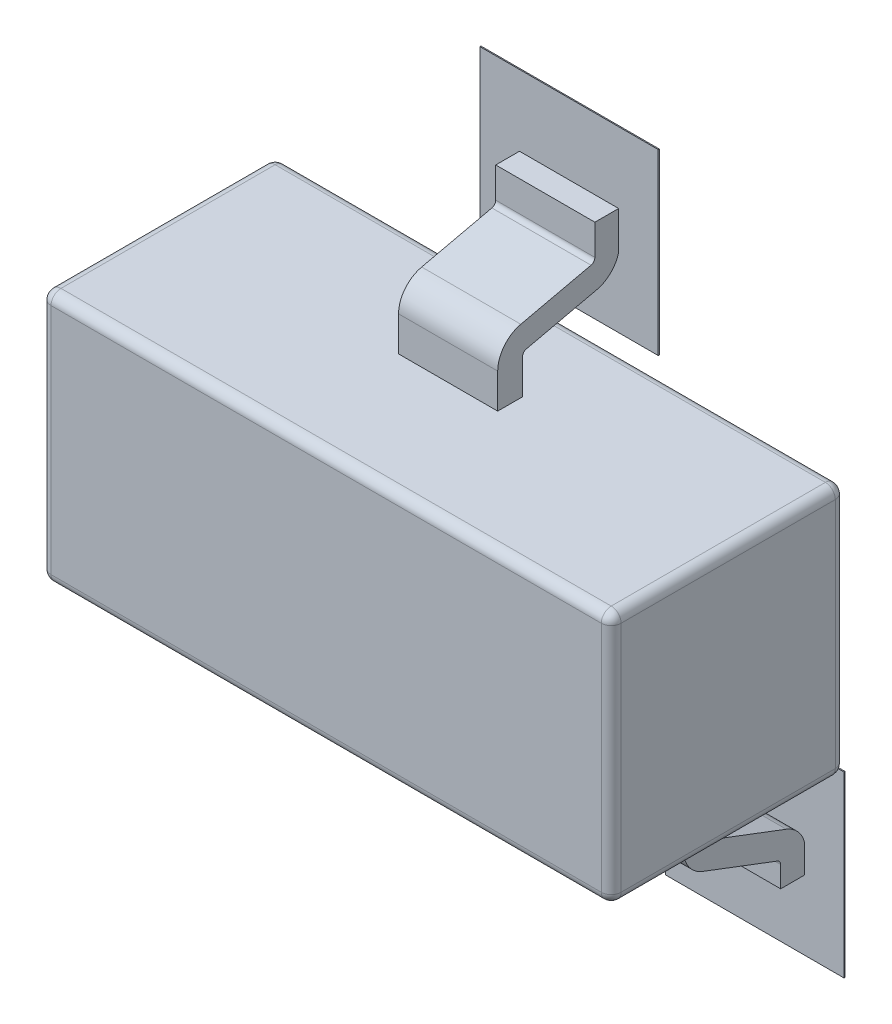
ISO-10303-21;
HEADER;
FILE_DESCRIPTION(('STEP AP214'),'2;1');
FILE_NAME('part.step','',(''),(''),'','','');
FILE_SCHEMA(('AUTOMOTIVE_DESIGN { 1 0 10303 214 1 1 1 1 }'));
ENDSEC;
DATA;
#1=APPLICATION_CONTEXT('core data for automotive mechanical design processes');
#2=APPLICATION_PROTOCOL_DEFINITION('international standard','automotive_design',2000,#1);
#3=PRODUCT_CONTEXT('',#1,'mechanical');
#4=PRODUCT('Part','Part','',(#3));
#5=PRODUCT_RELATED_PRODUCT_CATEGORY('part','',(#4));
#6=PRODUCT_DEFINITION_FORMATION('','',#4);
#7=PRODUCT_DEFINITION_CONTEXT('part definition',#1,'design');
#8=PRODUCT_DEFINITION('design','',#6,#7);
#9=PRODUCT_DEFINITION_SHAPE('','',#8);
#10=(LENGTH_UNIT() NAMED_UNIT(*) SI_UNIT(.MILLI.,.METRE.));
#11=(NAMED_UNIT(*) PLANE_ANGLE_UNIT() SI_UNIT($,.RADIAN.));
#12=(NAMED_UNIT(*) SI_UNIT($,.STERADIAN.) SOLID_ANGLE_UNIT());
#13=UNCERTAINTY_MEASURE_WITH_UNIT(LENGTH_MEASURE(1.E-05),#10,'distance_accuracy_value','');
#14=(GEOMETRIC_REPRESENTATION_CONTEXT(3) GLOBAL_UNCERTAINTY_ASSIGNED_CONTEXT((#13)) GLOBAL_UNIT_ASSIGNED_CONTEXT((#10,
#11,#12)) REPRESENTATION_CONTEXT('',''));
#15=CARTESIAN_POINT('',(0.,0.,0.));
#16=DIRECTION('',(0.,0.,1.));
#17=DIRECTION('',(1.,0.,0.));
#18=AXIS2_PLACEMENT_3D('',#15,#16,#17);
#19=CARTESIAN_POINT('',(1.205992,-1.2450064,0.0762));
#20=DIRECTION('',(0.,0.,-1.));
#21=DIRECTION('',(-1.,0.,0.));
#22=AXIS2_PLACEMENT_3D('',#19,#20,#21);
#23=PLANE('',#22);
#24=DIRECTION('',(1.,0.,0.));
#25=VECTOR('',#24,1.);
#26=CARTESIAN_POINT('',(0.4569968,1.5999968,0.0762));
#27=LINE('',#26,#25);
#28=CARTESIAN_POINT('',(0.4569968,1.5999968,0.0762));
#29=VERTEX_POINT('',#28);
#30=CARTESIAN_POINT('',(-0.4569968,1.5999968,0.0762));
#31=VERTEX_POINT('',#30);
#32=EDGE_CURVE('E717',#29,#31,#27,.F.);
#33=ORIENTED_EDGE('',*,*,#32,.F.);
#34=DIRECTION('',(0.,1.,0.));
#35=VECTOR('',#34,1.);
#36=CARTESIAN_POINT('',(0.4569968,0.6860032,0.0762));
#37=LINE('',#36,#35);
#38=CARTESIAN_POINT('',(0.4569968,0.6860032,0.0762));
#39=VERTEX_POINT('',#38);
#40=EDGE_CURVE('E698',#39,#29,#37,.T.);
#41=ORIENTED_EDGE('',*,*,#40,.F.);
#42=DIRECTION('',(1.,0.,0.));
#43=VECTOR('',#42,1.);
#44=CARTESIAN_POINT('',(-0.4569968,0.6860032,0.0762));
#45=LINE('',#44,#43);
#46=CARTESIAN_POINT('',(-0.4569968,0.6860032,0.0762));
#47=VERTEX_POINT('',#46);
#48=EDGE_CURVE('E707',#47,#39,#45,.T.);
#49=ORIENTED_EDGE('',*,*,#48,.F.);
#50=DIRECTION('',(0.,1.,0.));
#51=VECTOR('',#50,1.);
#52=CARTESIAN_POINT('',(-0.4569968,1.5999968,0.0762));
#53=LINE('',#52,#51);
#54=EDGE_CURVE('E712',#31,#47,#53,.F.);
#55=ORIENTED_EDGE('',*,*,#54,.F.);
#56=EDGE_LOOP('',(#33,#41,#49,#55));
#57=FACE_BOUND('',#56,.T.);
#58=ADVANCED_FACE('F16',(#57),#23,.T.);
#59=CARTESIAN_POINT('',(1.205992,-1.2450064,0.0762));
#60=DIRECTION('',(0.,0.,-1.));
#61=DIRECTION('',(-1.,0.,0.));
#62=AXIS2_PLACEMENT_3D('',#59,#60,#61);
#63=PLANE('',#62);
#64=DIRECTION('',(1.,0.,0.));
#65=VECTOR('',#64,1.);
#66=CARTESIAN_POINT('',(1.4089888,-0.6860032,0.0762));
#67=LINE('',#66,#65);
#68=CARTESIAN_POINT('',(1.4089888,-0.6860032,0.0762));
#69=VERTEX_POINT('',#68);
#70=CARTESIAN_POINT('',(0.4949952,-0.6860032,0.0762));
#71=VERTEX_POINT('',#70);
#72=EDGE_CURVE('E696',#69,#71,#67,.F.);
#73=ORIENTED_EDGE('',*,*,#72,.F.);
#74=DIRECTION('',(0.,1.,0.));
#75=VECTOR('',#74,1.);
#76=CARTESIAN_POINT('',(1.4089888,-1.5999968,0.0762));
#77=LINE('',#76,#75);
#78=CARTESIAN_POINT('',(1.4089888,-1.5999968,0.0762));
#79=VERTEX_POINT('',#78);
#80=EDGE_CURVE('E677',#79,#69,#77,.T.);
#81=ORIENTED_EDGE('',*,*,#80,.F.);
#82=DIRECTION('',(1.,0.,0.));
#83=VECTOR('',#82,1.);
#84=CARTESIAN_POINT('',(0.4949952,-1.5999968,0.0762));
#85=LINE('',#84,#83);
#86=CARTESIAN_POINT('',(0.4949952,-1.5999968,0.0762));
#87=VERTEX_POINT('',#86);
#88=EDGE_CURVE('E686',#87,#79,#85,.T.);
#89=ORIENTED_EDGE('',*,*,#88,.F.);
#90=DIRECTION('',(0.,1.,0.));
#91=VECTOR('',#90,1.);
#92=CARTESIAN_POINT('',(0.4949952,-0.6860032,0.0762));
#93=LINE('',#92,#91);
#94=EDGE_CURVE('E691',#71,#87,#93,.F.);
#95=ORIENTED_EDGE('',*,*,#94,.F.);
#96=EDGE_LOOP('',(#73,#81,#89,#95));
#97=FACE_BOUND('',#96,.T.);
#98=ADVANCED_FACE('F1296',(#97),#63,.T.);
#99=CARTESIAN_POINT('',(1.205992,-1.2450064,0.0762));
#100=DIRECTION('',(0.,0.,-1.));
#101=DIRECTION('',(-1.,0.,0.));
#102=AXIS2_PLACEMENT_3D('',#99,#100,#101);
#103=PLANE('',#102);
#104=DIRECTION('',(1.,0.,0.));
#105=VECTOR('',#104,1.);
#106=CARTESIAN_POINT('',(-0.4949952,-0.6860032,0.0762));
#107=LINE('',#106,#105);
#108=CARTESIAN_POINT('',(-0.4949952,-0.6860032,0.0762));
#109=VERTEX_POINT('',#108);
#110=CARTESIAN_POINT('',(-1.4089888,-0.6860032,0.0762));
#111=VERTEX_POINT('',#110);
#112=EDGE_CURVE('E675',#109,#111,#107,.F.);
#113=ORIENTED_EDGE('',*,*,#112,.F.);
#114=DIRECTION('',(0.,1.,0.));
#115=VECTOR('',#114,1.);
#116=CARTESIAN_POINT('',(-0.4949952,-1.5999968,0.0762));
#117=LINE('',#116,#115);
#118=CARTESIAN_POINT('',(-0.4949952,-1.5999968,0.0762));
#119=VERTEX_POINT('',#118);
#120=EDGE_CURVE('E646',#119,#109,#117,.T.);
#121=ORIENTED_EDGE('',*,*,#120,.F.);
#122=DIRECTION('',(1.,0.,0.));
#123=VECTOR('',#122,1.);
#124=CARTESIAN_POINT('',(-1.4089888,-1.5999968,0.0762));
#125=LINE('',#124,#123);
#126=CARTESIAN_POINT('',(-1.4089888,-1.5999968,0.0762));
#127=VERTEX_POINT('',#126);
#128=EDGE_CURVE('E665',#127,#119,#125,.T.);
#129=ORIENTED_EDGE('',*,*,#128,.F.);
#130=DIRECTION('',(0.,1.,0.));
#131=VECTOR('',#130,1.);
#132=CARTESIAN_POINT('',(-1.4089888,-0.6860032,0.0762));
#133=LINE('',#132,#131);
#134=EDGE_CURVE('E670',#111,#127,#133,.F.);
#135=ORIENTED_EDGE('',*,*,#134,.F.);
#136=EDGE_LOOP('',(#113,#121,#129,#135));
#137=FACE_BOUND('',#136,.T.);
#138=ADVANCED_FACE('F1293',(#137),#103,.T.);
#139=CARTESIAN_POINT('',(0.4569968,1.5999968,0.0762));
#140=DIRECTION('',(0.,1.,0.));
#141=DIRECTION('',(0.,0.,1.));
#142=AXIS2_PLACEMENT_3D('',#139,#140,#141);
#143=PLANE('',#142);
#144=DIRECTION('',(0.,0.,-1.));
#145=VECTOR('',#144,1.);
#146=CARTESIAN_POINT('',(0.4569968,1.5999968,0.0762));
#147=LINE('',#146,#145);
#148=CARTESIAN_POINT('',(0.4569968,1.5999968,0.081534));
#149=VERTEX_POINT('',#148);
#150=EDGE_CURVE('E704',#29,#149,#147,.F.);
#151=ORIENTED_EDGE('',*,*,#150,.F.);
#152=ORIENTED_EDGE('',*,*,#32,.T.);
#153=DIRECTION('',(0.,0.,1.));
#154=VECTOR('',#153,1.);
#155=CARTESIAN_POINT('',(-0.4569968,1.5999968,0.0762));
#156=LINE('',#155,#154);
#157=CARTESIAN_POINT('',(-0.4569968,1.5999968,0.081534));
#158=VERTEX_POINT('',#157);
#159=EDGE_CURVE('E714',#158,#31,#156,.F.);
#160=ORIENTED_EDGE('',*,*,#159,.F.);
#161=DIRECTION('',(1.,0.,0.));
#162=VECTOR('',#161,1.);
#163=CARTESIAN_POINT('',(0.,1.5999968,0.081534));
#164=LINE('',#163,#162);
#165=EDGE_CURVE('E643',#149,#158,#164,.F.);
#166=ORIENTED_EDGE('',*,*,#165,.F.);
#167=EDGE_LOOP('',(#151,#152,#160,#166));
#168=FACE_BOUND('',#167,.T.);
#169=ADVANCED_FACE('F1289',(#168),#143,.T.);
#170=CARTESIAN_POINT('',(-0.4569968,1.5999968,0.0762));
#171=DIRECTION('',(-1.,0.,0.));
#172=DIRECTION('',(0.,0.,1.));
#173=AXIS2_PLACEMENT_3D('',#170,#171,#172);
#174=PLANE('',#173);
#175=ORIENTED_EDGE('',*,*,#159,.T.);
#176=ORIENTED_EDGE('',*,*,#54,.T.);
#177=DIRECTION('',(0.,0.,-1.));
#178=VECTOR('',#177,1.);
#179=CARTESIAN_POINT('',(-0.4569968,0.6860032,0.0762));
#180=LINE('',#179,#178);
#181=CARTESIAN_POINT('',(-0.4569968,0.6860032,0.081534));
#182=VERTEX_POINT('',#181);
#183=EDGE_CURVE('E709',#182,#47,#180,.T.);
#184=ORIENTED_EDGE('',*,*,#183,.F.);
#185=DIRECTION('',(0.,1.,0.));
#186=VECTOR('',#185,1.);
#187=CARTESIAN_POINT('',(-0.4569968,0.,0.081534));
#188=LINE('',#187,#186);
#189=EDGE_CURVE('E640',#158,#182,#188,.F.);
#190=ORIENTED_EDGE('',*,*,#189,.F.);
#191=EDGE_LOOP('',(#175,#176,#184,#190));
#192=FACE_BOUND('',#191,.T.);
#193=ADVANCED_FACE('F1285',(#192),#174,.T.);
#194=CARTESIAN_POINT('',(-0.4569968,0.6860032,0.0762));
#195=DIRECTION('',(0.,-1.,0.));
#196=DIRECTION('',(0.,0.,-1.));
#197=AXIS2_PLACEMENT_3D('',#194,#195,#196);
#198=PLANE('',#197);
#199=ORIENTED_EDGE('',*,*,#183,.T.);
#200=ORIENTED_EDGE('',*,*,#48,.T.);
#201=DIRECTION('',(0.,0.,-1.));
#202=VECTOR('',#201,1.);
#203=CARTESIAN_POINT('',(0.4569968,0.6860032,0.0762));
#204=LINE('',#203,#202);
#205=CARTESIAN_POINT('',(0.4569968,0.6860032,0.081534));
#206=VERTEX_POINT('',#205);
#207=EDGE_CURVE('E701',#206,#39,#204,.T.);
#208=ORIENTED_EDGE('',*,*,#207,.F.);
#209=DIRECTION('',(1.,0.,0.));
#210=VECTOR('',#209,1.);
#211=CARTESIAN_POINT('',(0.,0.6860032,0.081534));
#212=LINE('',#211,#210);
#213=EDGE_CURVE('E637',#182,#206,#212,.T.);
#214=ORIENTED_EDGE('',*,*,#213,.F.);
#215=EDGE_LOOP('',(#199,#200,#208,#214));
#216=FACE_BOUND('',#215,.T.);
#217=ADVANCED_FACE('F1281',(#216),#198,.T.);
#218=CARTESIAN_POINT('',(0.4569968,0.6860032,0.0762));
#219=DIRECTION('',(1.,0.,0.));
#220=DIRECTION('',(0.,0.,-1.));
#221=AXIS2_PLACEMENT_3D('',#218,#219,#220);
#222=PLANE('',#221);
#223=ORIENTED_EDGE('',*,*,#207,.T.);
#224=ORIENTED_EDGE('',*,*,#40,.T.);
#225=ORIENTED_EDGE('',*,*,#150,.T.);
#226=DIRECTION('',(0.,1.,0.));
#227=VECTOR('',#226,1.);
#228=CARTESIAN_POINT('',(0.4569968,0.,0.081534));
#229=LINE('',#228,#227);
#230=EDGE_CURVE('E632',#206,#149,#229,.T.);
#231=ORIENTED_EDGE('',*,*,#230,.F.);
#232=EDGE_LOOP('',(#223,#224,#225,#231));
#233=FACE_BOUND('',#232,.T.);
#234=ADVANCED_FACE('F1277',(#233),#222,.T.);
#235=CARTESIAN_POINT('',(1.4089888,-0.6860032,0.0762));
#236=DIRECTION('',(0.,1.,0.));
#237=DIRECTION('',(0.,0.,1.));
#238=AXIS2_PLACEMENT_3D('',#235,#236,#237);
#239=PLANE('',#238);
#240=DIRECTION('',(0.,0.,-1.));
#241=VECTOR('',#240,1.);
#242=CARTESIAN_POINT('',(1.4089888,-0.6860032,0.0762));
#243=LINE('',#242,#241);
#244=CARTESIAN_POINT('',(1.4089888,-0.6860032,0.081534));
#245=VERTEX_POINT('',#244);
#246=EDGE_CURVE('E683',#69,#245,#243,.F.);
#247=ORIENTED_EDGE('',*,*,#246,.F.);
#248=ORIENTED_EDGE('',*,*,#72,.T.);
#249=DIRECTION('',(0.,0.,1.));
#250=VECTOR('',#249,1.);
#251=CARTESIAN_POINT('',(0.4949952,-0.6860032,0.0762));
#252=LINE('',#251,#250);
#253=CARTESIAN_POINT('',(0.4949952,-0.6860032,0.081534));
#254=VERTEX_POINT('',#253);
#255=EDGE_CURVE('E693',#254,#71,#252,.F.);
#256=ORIENTED_EDGE('',*,*,#255,.F.);
#257=DIRECTION('',(1.,0.,0.));
#258=VECTOR('',#257,1.);
#259=CARTESIAN_POINT('',(0.,-0.6860032,0.081534));
#260=LINE('',#259,#258);
#261=EDGE_CURVE('E1309',#245,#254,#260,.F.);
#262=ORIENTED_EDGE('',*,*,#261,.F.);
#263=EDGE_LOOP('',(#247,#248,#256,#262));
#264=FACE_BOUND('',#263,.T.);
#265=ADVANCED_FACE('F1273',(#264),#239,.T.);
#266=CARTESIAN_POINT('',(0.4949952,-0.6860032,0.0762));
#267=DIRECTION('',(-1.,0.,0.));
#268=DIRECTION('',(0.,0.,1.));
#269=AXIS2_PLACEMENT_3D('',#266,#267,#268);
#270=PLANE('',#269);
#271=ORIENTED_EDGE('',*,*,#255,.T.);
#272=ORIENTED_EDGE('',*,*,#94,.T.);
#273=DIRECTION('',(0.,0.,-1.));
#274=VECTOR('',#273,1.);
#275=CARTESIAN_POINT('',(0.4949952,-1.5999968,0.0762));
#276=LINE('',#275,#274);
#277=CARTESIAN_POINT('',(0.4949952,-1.5999968,0.081534));
#278=VERTEX_POINT('',#277);
#279=EDGE_CURVE('E688',#278,#87,#276,.T.);
#280=ORIENTED_EDGE('',*,*,#279,.F.);
#281=DIRECTION('',(0.,1.,0.));
#282=VECTOR('',#281,1.);
#283=CARTESIAN_POINT('',(0.4949952,0.,0.081534));
#284=LINE('',#283,#282);
#285=EDGE_CURVE('E1318',#254,#278,#284,.F.);
#286=ORIENTED_EDGE('',*,*,#285,.F.);
#287=EDGE_LOOP('',(#271,#272,#280,#286));
#288=FACE_BOUND('',#287,.T.);
#289=ADVANCED_FACE('F1269',(#288),#270,.T.);
#290=CARTESIAN_POINT('',(0.4949952,-1.5999968,0.0762));
#291=DIRECTION('',(0.,-1.,0.));
#292=DIRECTION('',(0.,0.,-1.));
#293=AXIS2_PLACEMENT_3D('',#290,#291,#292);
#294=PLANE('',#293);
#295=ORIENTED_EDGE('',*,*,#279,.T.);
#296=ORIENTED_EDGE('',*,*,#88,.T.);
#297=DIRECTION('',(0.,0.,-1.));
#298=VECTOR('',#297,1.);
#299=CARTESIAN_POINT('',(1.4089888,-1.5999968,0.0762));
#300=LINE('',#299,#298);
#301=CARTESIAN_POINT('',(1.4089888,-1.5999968,0.081534));
#302=VERTEX_POINT('',#301);
#303=EDGE_CURVE('E680',#302,#79,#300,.T.);
#304=ORIENTED_EDGE('',*,*,#303,.F.);
#305=DIRECTION('',(1.,0.,0.));
#306=VECTOR('',#305,1.);
#307=CARTESIAN_POINT('',(0.,-1.5999968,0.081534));
#308=LINE('',#307,#306);
#309=EDGE_CURVE('E1315',#278,#302,#308,.T.);
#310=ORIENTED_EDGE('',*,*,#309,.F.);
#311=EDGE_LOOP('',(#295,#296,#304,#310));
#312=FACE_BOUND('',#311,.T.);
#313=ADVANCED_FACE('F1265',(#312),#294,.T.);
#314=CARTESIAN_POINT('',(1.4089888,-1.5999968,0.0762));
#315=DIRECTION('',(1.,0.,0.));
#316=DIRECTION('',(0.,0.,-1.));
#317=AXIS2_PLACEMENT_3D('',#314,#315,#316);
#318=PLANE('',#317);
#319=ORIENTED_EDGE('',*,*,#303,.T.);
#320=ORIENTED_EDGE('',*,*,#80,.T.);
#321=ORIENTED_EDGE('',*,*,#246,.T.);
#322=DIRECTION('',(0.,1.,0.));
#323=VECTOR('',#322,1.);
#324=CARTESIAN_POINT('',(1.4089888,0.,0.081534));
#325=LINE('',#324,#323);
#326=EDGE_CURVE('E1312',#302,#245,#325,.T.);
#327=ORIENTED_EDGE('',*,*,#326,.F.);
#328=EDGE_LOOP('',(#319,#320,#321,#327));
#329=FACE_BOUND('',#328,.T.);
#330=ADVANCED_FACE('F1261',(#329),#318,.T.);
#331=CARTESIAN_POINT('',(-0.4949952,-0.6860032,0.0762));
#332=DIRECTION('',(0.,1.,0.));
#333=DIRECTION('',(0.,0.,1.));
#334=AXIS2_PLACEMENT_3D('',#331,#332,#333);
#335=PLANE('',#334);
#336=DIRECTION('',(0.,0.,-1.));
#337=VECTOR('',#336,1.);
#338=CARTESIAN_POINT('',(-0.4949952,-0.6860032,0.0762));
#339=LINE('',#338,#337);
#340=CARTESIAN_POINT('',(-0.4949952,-0.6860032,0.081534));
#341=VERTEX_POINT('',#340);
#342=EDGE_CURVE('E662',#109,#341,#339,.F.);
#343=ORIENTED_EDGE('',*,*,#342,.F.);
#344=ORIENTED_EDGE('',*,*,#112,.T.);
#345=DIRECTION('',(0.,0.,1.));
#346=VECTOR('',#345,1.);
#347=CARTESIAN_POINT('',(-1.4089888,-0.6860032,0.0762));
#348=LINE('',#347,#346);
#349=CARTESIAN_POINT('',(-1.4089888,-0.6860032,0.081534));
#350=VERTEX_POINT('',#349);
#351=EDGE_CURVE('E672',#350,#111,#348,.F.);
#352=ORIENTED_EDGE('',*,*,#351,.F.);
#353=DIRECTION('',(1.,0.,0.));
#354=VECTOR('',#353,1.);
#355=CARTESIAN_POINT('',(0.,-0.6860032,0.081534));
#356=LINE('',#355,#354);
#357=EDGE_CURVE('E1331',#341,#350,#356,.F.);
#358=ORIENTED_EDGE('',*,*,#357,.F.);
#359=EDGE_LOOP('',(#343,#344,#352,#358));
#360=FACE_BOUND('',#359,.T.);
#361=ADVANCED_FACE('F1257',(#360),#335,.T.);
#362=CARTESIAN_POINT('',(-1.4089888,-0.6860032,0.0762));
#363=DIRECTION('',(-1.,0.,0.));
#364=DIRECTION('',(0.,0.,1.));
#365=AXIS2_PLACEMENT_3D('',#362,#363,#364);
#366=PLANE('',#365);
#367=ORIENTED_EDGE('',*,*,#351,.T.);
#368=ORIENTED_EDGE('',*,*,#134,.T.);
#369=DIRECTION('',(0.,0.,-1.));
#370=VECTOR('',#369,1.);
#371=CARTESIAN_POINT('',(-1.4089888,-1.5999968,0.0762));
#372=LINE('',#371,#370);
#373=CARTESIAN_POINT('',(-1.4089888,-1.5999968,0.081534));
#374=VERTEX_POINT('',#373);
#375=EDGE_CURVE('E667',#374,#127,#372,.T.);
#376=ORIENTED_EDGE('',*,*,#375,.F.);
#377=DIRECTION('',(0.,1.,0.));
#378=VECTOR('',#377,1.);
#379=CARTESIAN_POINT('',(-1.4089888,0.,0.081534));
#380=LINE('',#379,#378);
#381=EDGE_CURVE('E1431',#350,#374,#380,.F.);
#382=ORIENTED_EDGE('',*,*,#381,.F.);
#383=EDGE_LOOP('',(#367,#368,#376,#382));
#384=FACE_BOUND('',#383,.T.);
#385=ADVANCED_FACE('F1254',(#384),#366,.T.);
#386=CARTESIAN_POINT('',(-1.4089888,-1.5999968,0.0762));
#387=DIRECTION('',(0.,-1.,0.));
#388=DIRECTION('',(0.,0.,-1.));
#389=AXIS2_PLACEMENT_3D('',#386,#387,#388);
#390=PLANE('',#389);
#391=ORIENTED_EDGE('',*,*,#375,.T.);
#392=ORIENTED_EDGE('',*,*,#128,.T.);
#393=DIRECTION('',(0.,0.,-1.));
#394=VECTOR('',#393,1.);
#395=CARTESIAN_POINT('',(-0.4949952,-1.5999968,0.0762));
#396=LINE('',#395,#394);
#397=CARTESIAN_POINT('',(-0.4949952,-1.5999968,0.081534));
#398=VERTEX_POINT('',#397);
#399=EDGE_CURVE('E60',#398,#119,#396,.T.);
#400=ORIENTED_EDGE('',*,*,#399,.F.);
#401=DIRECTION('',(1.,0.,0.));
#402=VECTOR('',#401,1.);
#403=CARTESIAN_POINT('',(0.,-1.5999968,0.081534));
#404=LINE('',#403,#402);
#405=EDGE_CURVE('E1428',#374,#398,#404,.T.);
#406=ORIENTED_EDGE('',*,*,#405,.F.);
#407=EDGE_LOOP('',(#391,#392,#400,#406));
#408=FACE_BOUND('',#407,.T.);
#409=ADVANCED_FACE('F1250',(#408),#390,.T.);
#410=CARTESIAN_POINT('',(-0.4949952,-1.5999968,0.0762));
#411=DIRECTION('',(1.,0.,0.));
#412=DIRECTION('',(0.,0.,-1.));
#413=AXIS2_PLACEMENT_3D('',#410,#411,#412);
#414=PLANE('',#413);
#415=ORIENTED_EDGE('',*,*,#399,.T.);
#416=ORIENTED_EDGE('',*,*,#120,.T.);
#417=ORIENTED_EDGE('',*,*,#342,.T.);
#418=DIRECTION('',(0.,1.,0.));
#419=VECTOR('',#418,1.);
#420=CARTESIAN_POINT('',(-0.4949952,0.,0.081534));
#421=LINE('',#420,#419);
#422=EDGE_CURVE('E1425',#398,#341,#421,.T.);
#423=ORIENTED_EDGE('',*,*,#422,.F.);
#424=EDGE_LOOP('',(#415,#416,#417,#423));
#425=FACE_BOUND('',#424,.T.);
#426=ADVANCED_FACE('F1246',(#425),#414,.T.);
#427=CARTESIAN_POINT('',(0.,0.,0.081534));
#428=DIRECTION('',(0.,0.,1.));
#429=DIRECTION('',(1.,0.,0.));
#430=AXIS2_PLACEMENT_3D('',#427,#428,#429);
#431=PLANE('',#430);
#432=DIRECTION('',(1.,0.,0.));
#433=VECTOR('',#432,1.);
#434=CARTESIAN_POINT('',(-0.254,1.04101064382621,0.0815339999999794));
#435=LINE('',#434,#433);
#436=CARTESIAN_POINT('',(-0.254,1.04101064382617,0.0815339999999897));
#437=VERTEX_POINT('',#436);
#438=CARTESIAN_POINT('',(0.254,1.04101064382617,0.0815339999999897));
#439=VERTEX_POINT('',#438);
#440=EDGE_CURVE('E579',#437,#439,#435,.T.);
#441=ORIENTED_EDGE('',*,*,#440,.F.);
#442=DIRECTION('',(0.,1.,0.));
#443=VECTOR('',#442,1.);
#444=CARTESIAN_POINT('',(-0.254,0.,0.081534));
#445=LINE('',#444,#443);
#446=CARTESIAN_POINT('',(-0.254,1.23720111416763,0.081534));
#447=VERTEX_POINT('',#446);
#448=EDGE_CURVE('E611',#437,#447,#445,.T.);
#449=ORIENTED_EDGE('',*,*,#448,.T.);
#450=DIRECTION('',(1.,0.,0.));
#451=VECTOR('',#450,1.);
#452=CARTESIAN_POINT('',(-0.254,1.23720111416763,0.081534));
#453=LINE('',#452,#451);
#454=CARTESIAN_POINT('',(0.254,1.23720111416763,0.081534));
#455=VERTEX_POINT('',#454);
#456=EDGE_CURVE('E622',#455,#447,#453,.F.);
#457=ORIENTED_EDGE('',*,*,#456,.F.);
#458=DIRECTION('',(0.,1.,0.));
#459=VECTOR('',#458,1.);
#460=CARTESIAN_POINT('',(0.254,0.,0.081534));
#461=LINE('',#460,#459);
#462=EDGE_CURVE('E649',#439,#455,#461,.T.);
#463=ORIENTED_EDGE('',*,*,#462,.F.);
#464=EDGE_LOOP('',(#441,#449,#457,#463));
#465=FACE_BOUND('',#464,.T.);
#466=ORIENTED_EDGE('',*,*,#213,.T.);
#467=ORIENTED_EDGE('',*,*,#230,.T.);
#468=ORIENTED_EDGE('',*,*,#165,.T.);
#469=ORIENTED_EDGE('',*,*,#189,.T.);
#470=EDGE_LOOP('',(#466,#467,#468,#469));
#471=FACE_BOUND('',#470,.T.);
#472=ADVANCED_FACE('F1242',(#465,#471),#431,.T.);
#473=CARTESIAN_POINT('',(-0.254,1.23720111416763,0.0762));
#474=DIRECTION('',(0.,1.,0.));
#475=DIRECTION('',(0.,0.,1.));
#476=AXIS2_PLACEMENT_3D('',#473,#474,#475);
#477=PLANE('',#476);
#478=DIRECTION('',(0.,0.,-1.));
#479=VECTOR('',#478,1.);
#480=CARTESIAN_POINT('',(0.254,1.23720111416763,0.));
#481=LINE('',#480,#479);
#482=CARTESIAN_POINT('',(0.254,1.23720111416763,0.2032));
#483=VERTEX_POINT('',#482);
#484=EDGE_CURVE('E450',#455,#483,#481,.F.);
#485=ORIENTED_EDGE('',*,*,#484,.F.);
#486=ORIENTED_EDGE('',*,*,#456,.T.);
#487=DIRECTION('',(0.,0.,-1.));
#488=VECTOR('',#487,1.);
#489=CARTESIAN_POINT('',(-0.254,1.23720111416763,0.));
#490=LINE('',#489,#488);
#491=CARTESIAN_POINT('',(-0.254,1.23720111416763,0.2032));
#492=VERTEX_POINT('',#491);
#493=EDGE_CURVE('E625',#447,#492,#490,.F.);
#494=ORIENTED_EDGE('',*,*,#493,.T.);
#495=DIRECTION('',(1.,0.,0.));
#496=VECTOR('',#495,1.);
#497=CARTESIAN_POINT('',(-0.254,1.23720111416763,0.2032));
#498=LINE('',#497,#496);
#499=EDGE_CURVE('E619',#483,#492,#498,.F.);
#500=ORIENTED_EDGE('',*,*,#499,.F.);
#501=EDGE_LOOP('',(#485,#486,#494,#500));
#502=FACE_BOUND('',#501,.T.);
#503=ADVANCED_FACE('F1239',(#502),#477,.T.);
#504=CARTESIAN_POINT('',(-0.254,1.23720111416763,0.2032));
#505=DIRECTION('',(0.,0.,1.));
#506=DIRECTION('',(1.,0.,0.));
#507=AXIS2_PLACEMENT_3D('',#504,#505,#506);
#508=PLANE('',#507);
#509=ORIENTED_EDGE('',*,*,#499,.T.);
#510=DIRECTION('',(0.,1.,0.));
#511=VECTOR('',#510,1.);
#512=CARTESIAN_POINT('',(-0.254,0.,0.2032));
#513=LINE('',#512,#511);
#514=CARTESIAN_POINT('',(-0.254,1.08097752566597,0.2032));
#515=VERTEX_POINT('',#514);
#516=EDGE_CURVE('E627',#492,#515,#513,.F.);
#517=ORIENTED_EDGE('',*,*,#516,.T.);
#518=DIRECTION('',(1.,0.,0.));
#519=VECTOR('',#518,1.);
#520=CARTESIAN_POINT('',(-0.254,1.08097752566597,0.2032));
#521=LINE('',#520,#519);
#522=CARTESIAN_POINT('',(0.254,1.08097752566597,0.2032));
#523=VERTEX_POINT('',#522);
#524=EDGE_CURVE('E420',#515,#523,#521,.T.);
#525=ORIENTED_EDGE('',*,*,#524,.T.);
#526=DIRECTION('',(0.,1.,0.));
#527=VECTOR('',#526,1.);
#528=CARTESIAN_POINT('',(0.254,0.,0.2032));
#529=LINE('',#528,#527);
#530=EDGE_CURVE('E448',#483,#523,#529,.F.);
#531=ORIENTED_EDGE('',*,*,#530,.F.);
#532=EDGE_LOOP('',(#509,#517,#525,#531));
#533=FACE_BOUND('',#532,.T.);
#534=ADVANCED_FACE('F1236',(#533),#508,.T.);
#535=CARTESIAN_POINT('',(-0.254,1.08097752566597,0.2286));
#536=DIRECTION('',(1.,0.,0.));
#537=DIRECTION('',(0.,0.,-1.));
#538=AXIS2_PLACEMENT_3D('',#535,#536,#537);
#539=CYLINDRICAL_SURFACE('',#538,0.0254);
#540=CARTESIAN_POINT('',(0.254,1.08097752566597,0.2286));
#541=DIRECTION('',(1.,0.,0.));
#542=DIRECTION('',(0.,0.,-1.));
#543=AXIS2_PLACEMENT_3D('',#540,#541,#542);
#544=CIRCLE('',#543,0.0254);
#545=CARTESIAN_POINT('',(0.254,1.05621479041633,0.222946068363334));
#546=VERTEX_POINT('',#545);
#547=EDGE_CURVE('E429',#523,#546,#544,.F.);
#548=ORIENTED_EDGE('',*,*,#547,.F.);
#549=ORIENTED_EDGE('',*,*,#524,.F.);
#550=CARTESIAN_POINT('',(-0.254,1.08097752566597,0.2286));
#551=DIRECTION('',(1.,0.,0.));
#552=DIRECTION('',(0.,0.,-1.));
#553=AXIS2_PLACEMENT_3D('',#550,#551,#552);
#554=CIRCLE('',#553,0.0254);
#555=CARTESIAN_POINT('',(-0.254,1.05621479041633,0.222946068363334));
#556=VERTEX_POINT('',#555);
#557=EDGE_CURVE('E432',#515,#556,#554,.F.);
#558=ORIENTED_EDGE('',*,*,#557,.T.);
#559=DIRECTION('',(1.,0.,0.));
#560=VECTOR('',#559,1.);
#561=CARTESIAN_POINT('',(-0.254,1.05621479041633,0.222946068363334));
#562=LINE('',#561,#560);
#563=EDGE_CURVE('E425',#546,#556,#562,.F.);
#564=ORIENTED_EDGE('',*,*,#563,.F.);
#565=EDGE_LOOP('',(#548,#549,#558,#564));
#566=FACE_BOUND('',#565,.T.);
#567=ADVANCED_FACE('F427',(#566),#539,.F.);
#568=CARTESIAN_POINT('',(-0.254,1.05621479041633,0.222946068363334));
#569=DIRECTION('',(0.,0.974910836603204,0.222595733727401));
#570=DIRECTION('',(0.,-0.222595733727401,0.974910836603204));
#571=AXIS2_PLACEMENT_3D('',#568,#569,#570);
#572=PLANE('',#571);
#573=ORIENTED_EDGE('',*,*,#563,.T.);
#574=DIRECTION('',(0.,-0.222595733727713,0.974910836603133));
#575=VECTOR('',#574,1.);
#576=CARTESIAN_POINT('',(-0.254,1.05621479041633,0.222946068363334));
#577=LINE('',#576,#575);
#578=CARTESIAN_POINT('',(-0.254,0.974076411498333,0.582690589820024));
#579=VERTEX_POINT('',#578);
#580=EDGE_CURVE('E870',#556,#579,#577,.T.);
#581=ORIENTED_EDGE('',*,*,#580,.T.);
#582=DIRECTION('',(1.,0.,0.));
#583=VECTOR('',#582,1.);
#584=CARTESIAN_POINT('',(-0.254,0.974076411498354,0.582690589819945));
#585=LINE('',#584,#583);
#586=CARTESIAN_POINT('',(0.254,0.974076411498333,0.582690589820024));
#587=VERTEX_POINT('',#586);
#588=EDGE_CURVE('E435',#587,#579,#585,.F.);
#589=ORIENTED_EDGE('',*,*,#588,.F.);
#590=DIRECTION('',(0.,-0.222595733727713,0.974910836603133));
#591=VECTOR('',#590,1.);
#592=CARTESIAN_POINT('',(0.254,1.05621479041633,0.222946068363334));
#593=LINE('',#592,#591);
#594=EDGE_CURVE('E438',#546,#587,#593,.T.);
#595=ORIENTED_EDGE('',*,*,#594,.F.);
#596=EDGE_LOOP('',(#573,#581,#589,#595));
#597=FACE_BOUND('',#596,.T.);
#598=ADVANCED_FACE('F439',(#597),#572,.T.);
#599=CARTESIAN_POINT('',(-0.254,0.8255,0.548767));
#600=DIRECTION('',(1.,0.,0.));
#601=DIRECTION('',(0.,0.,-1.));
#602=AXIS2_PLACEMENT_3D('',#599,#600,#601);
#603=CYLINDRICAL_SURFACE('',#602,0.1524);
#604=ORIENTED_EDGE('',*,*,#588,.T.);
#605=CARTESIAN_POINT('',(-0.254,0.8255,0.548767));
#606=DIRECTION('',(1.,0.,0.));
#607=DIRECTION('',(0.,0.,-1.));
#608=AXIS2_PLACEMENT_3D('',#605,#606,#607);
#609=CIRCLE('',#608,0.1524);
#610=CARTESIAN_POINT('',(-0.254,0.8255,0.701167));
#611=VERTEX_POINT('',#610);
#612=EDGE_CURVE('E867',#579,#611,#609,.T.);
#613=ORIENTED_EDGE('',*,*,#612,.T.);
#614=DIRECTION('',(1.,0.,0.));
#615=VECTOR('',#614,1.);
#616=CARTESIAN_POINT('',(-0.254,0.8255,0.701167));
#617=LINE('',#616,#615);
#618=CARTESIAN_POINT('',(0.254,0.8255,0.701167));
#619=VERTEX_POINT('',#618);
#620=EDGE_CURVE('E608',#619,#611,#617,.F.);
#621=ORIENTED_EDGE('',*,*,#620,.F.);
#622=CARTESIAN_POINT('',(0.254,0.8255,0.548767));
#623=DIRECTION('',(1.,0.,0.));
#624=DIRECTION('',(0.,0.,-1.));
#625=AXIS2_PLACEMENT_3D('',#622,#623,#624);
#626=CIRCLE('',#625,0.1524);
#627=EDGE_CURVE('E443',#587,#619,#626,.T.);
#628=ORIENTED_EDGE('',*,*,#627,.F.);
#629=EDGE_LOOP('',(#604,#613,#621,#628));
#630=FACE_BOUND('',#629,.T.);
#631=ADVANCED_FACE('F1227',(#630),#603,.T.);
#632=CARTESIAN_POINT('',(-0.254,0.8255,0.548767));
#633=DIRECTION('',(1.,0.,0.));
#634=DIRECTION('',(0.,0.,-1.));
#635=AXIS2_PLACEMENT_3D('',#632,#633,#634);
#636=CYLINDRICAL_SURFACE('',#635,0.0254);
#637=CARTESIAN_POINT('',(0.254,0.8255,0.548767));
#638=DIRECTION('',(1.,0.,0.));
#639=DIRECTION('',(0.,0.,-1.));
#640=AXIS2_PLACEMENT_3D('',#637,#638,#639);
#641=CIRCLE('',#640,0.0254);
#642=CARTESIAN_POINT('',(0.254,0.8255,0.574167));
#643=VERTEX_POINT('',#642);
#644=CARTESIAN_POINT('',(0.254,0.850262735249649,0.554420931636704));
#645=VERTEX_POINT('',#644);
#646=EDGE_CURVE('E874',#643,#645,#641,.F.);
#647=ORIENTED_EDGE('',*,*,#646,.F.);
#648=DIRECTION('',(-1.,0.,0.));
#649=VECTOR('',#648,1.);
#650=CARTESIAN_POINT('',(-0.254,0.8255,0.574167));
#651=LINE('',#650,#649);
#652=CARTESIAN_POINT('',(-0.254,0.8255,0.574167));
#653=VERTEX_POINT('',#652);
#654=EDGE_CURVE('E458',#653,#643,#651,.F.);
#655=ORIENTED_EDGE('',*,*,#654,.F.);
#656=CARTESIAN_POINT('',(-0.254,0.8255,0.548767));
#657=DIRECTION('',(1.,0.,0.));
#658=DIRECTION('',(0.,0.,-1.));
#659=AXIS2_PLACEMENT_3D('',#656,#657,#658);
#660=CIRCLE('',#659,0.0254);
#661=CARTESIAN_POINT('',(-0.254,0.850262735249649,0.554420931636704));
#662=VERTEX_POINT('',#661);
#663=EDGE_CURVE('E864',#653,#662,#660,.F.);
#664=ORIENTED_EDGE('',*,*,#663,.T.);
#665=DIRECTION('',(1.,0.,0.));
#666=VECTOR('',#665,1.);
#667=CARTESIAN_POINT('',(-0.254,0.85026273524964,0.554420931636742));
#668=LINE('',#667,#666);
#669=EDGE_CURVE('E589',#645,#662,#668,.F.);
#670=ORIENTED_EDGE('',*,*,#669,.F.);
#671=EDGE_LOOP('',(#647,#655,#664,#670));
#672=FACE_BOUND('',#671,.T.);
#673=ADVANCED_FACE('F1221',(#672),#636,.F.);
#674=CARTESIAN_POINT('',(-0.254,0.85026273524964,0.554420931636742));
#675=DIRECTION('',(0.,-0.974910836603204,-0.222595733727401));
#676=DIRECTION('',(0.,0.222595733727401,-0.974910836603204));
#677=AXIS2_PLACEMENT_3D('',#674,#675,#676);
#678=PLANE('',#677);
#679=ORIENTED_EDGE('',*,*,#669,.T.);
#680=DIRECTION('',(0.,0.222595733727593,-0.974910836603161));
#681=VECTOR('',#680,1.);
#682=CARTESIAN_POINT('',(-0.254,0.85026273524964,0.554420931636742));
#683=LINE('',#682,#681);
#684=CARTESIAN_POINT('',(-0.254,0.932401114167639,0.194676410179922));
#685=VERTEX_POINT('',#684);
#686=EDGE_CURVE('E863',#662,#685,#683,.T.);
#687=ORIENTED_EDGE('',*,*,#686,.T.);
#688=DIRECTION('',(1.,0.,0.));
#689=VECTOR('',#688,1.);
#690=CARTESIAN_POINT('',(-0.254,0.932401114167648,0.194676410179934));
#691=LINE('',#690,#689);
#692=CARTESIAN_POINT('',(0.254,0.932401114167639,0.194676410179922));
#693=VERTEX_POINT('',#692);
#694=EDGE_CURVE('E586',#693,#685,#691,.F.);
#695=ORIENTED_EDGE('',*,*,#694,.F.);
#696=DIRECTION('',(0.,0.222595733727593,-0.974910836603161));
#697=VECTOR('',#696,1.);
#698=CARTESIAN_POINT('',(0.254,0.85026273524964,0.554420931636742));
#699=LINE('',#698,#697);
#700=EDGE_CURVE('E873',#645,#693,#699,.T.);
#701=ORIENTED_EDGE('',*,*,#700,.F.);
#702=EDGE_LOOP('',(#679,#687,#695,#701));
#703=FACE_BOUND('',#702,.T.);
#704=ADVANCED_FACE('F1216',(#703),#678,.T.);
#705=CARTESIAN_POINT('',(-0.254,1.08097752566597,0.2286));
#706=DIRECTION('',(1.,0.,0.));
#707=DIRECTION('',(0.,0.,-1.));
#708=AXIS2_PLACEMENT_3D('',#705,#706,#707);
#709=CYLINDRICAL_SURFACE('',#708,0.1524);
#710=CARTESIAN_POINT('',(-0.254,1.08097752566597,0.2286));
#711=DIRECTION('',(1.,0.,0.));
#712=DIRECTION('',(0.,0.,-1.));
#713=AXIS2_PLACEMENT_3D('',#710,#711,#712);
#714=CIRCLE('',#713,0.1524);
#715=EDGE_CURVE('E860',#685,#437,#714,.T.);
#716=ORIENTED_EDGE('',*,*,#715,.T.);
#717=ORIENTED_EDGE('',*,*,#440,.T.);
#718=CARTESIAN_POINT('',(0.254,1.08097752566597,0.2286));
#719=DIRECTION('',(1.,0.,0.));
#720=DIRECTION('',(0.,0.,-1.));
#721=AXIS2_PLACEMENT_3D('',#718,#719,#720);
#722=CIRCLE('',#721,0.1524);
#723=EDGE_CURVE('E872',#693,#439,#722,.T.);
#724=ORIENTED_EDGE('',*,*,#723,.F.);
#725=ORIENTED_EDGE('',*,*,#694,.T.);
#726=EDGE_LOOP('',(#716,#717,#724,#725));
#727=FACE_BOUND('',#726,.T.);
#728=ADVANCED_FACE('F1212',(#727),#709,.T.);
#729=CARTESIAN_POINT('',(-1.4097,0.5969,0.1778));
#730=DIRECTION('',(-0.707106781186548,0.,-0.707106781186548));
#731=DIRECTION('',(0.,1.,0.));
#732=AXIS2_PLACEMENT_3D('',#729,#730,#731);
#733=SPHERICAL_SURFACE('',#732,0.0508);
#734=CARTESIAN_POINT('',(-1.4097,0.5969,0.1778));
#735=DIRECTION('',(0.,-1.,0.));
#736=DIRECTION('',(0.,0.,-1.));
#737=AXIS2_PLACEMENT_3D('',#734,#735,#736);
#738=CIRCLE('',#737,0.0508);
#739=CARTESIAN_POINT('',(-1.4605,0.5969,0.1778));
#740=VERTEX_POINT('',#739);
#741=CARTESIAN_POINT('',(-1.44562102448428,0.5969,0.141878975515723));
#742=VERTEX_POINT('',#741);
#743=EDGE_CURVE('E856',#740,#742,#738,.T.);
#744=ORIENTED_EDGE('',*,*,#743,.F.);
#745=CARTESIAN_POINT('',(-1.4097,0.5969,0.1778));
#746=DIRECTION('',(0.,0.,-1.));
#747=DIRECTION('',(-1.,0.,0.));
#748=AXIS2_PLACEMENT_3D('',#745,#746,#747);
#749=CIRCLE('',#748,0.0508);
#750=CARTESIAN_POINT('',(-1.4097,0.6477,0.1778));
#751=VERTEX_POINT('',#750);
#752=EDGE_CURVE('E857',#751,#740,#749,.F.);
#753=ORIENTED_EDGE('',*,*,#752,.F.);
#754=CARTESIAN_POINT('',(-1.4097,0.5969,0.1778));
#755=DIRECTION('',(-1.,0.,0.));
#756=DIRECTION('',(0.,0.,1.));
#757=AXIS2_PLACEMENT_3D('',#754,#755,#756);
#758=CIRCLE('',#757,0.0508);
#759=CARTESIAN_POINT('',(-1.4097,0.5969,0.127));
#760=VERTEX_POINT('',#759);
#761=EDGE_CURVE('E19',#760,#751,#758,.F.);
#762=ORIENTED_EDGE('',*,*,#761,.F.);
#763=CARTESIAN_POINT('',(-1.4097,0.5969,0.1778));
#764=DIRECTION('',(0.,-1.,0.));
#765=DIRECTION('',(0.,0.,-1.));
#766=AXIS2_PLACEMENT_3D('',#763,#764,#765);
#767=CIRCLE('',#766,0.0508);
#768=EDGE_CURVE('E583',#742,#760,#767,.T.);
#769=ORIENTED_EDGE('',*,*,#768,.F.);
#770=EDGE_LOOP('',(#744,#753,#762,#769));
#771=FACE_BOUND('',#770,.T.);
#772=ADVANCED_FACE('F562',(#771),#733,.T.);
#773=CARTESIAN_POINT('',(-1.4097,-0.5969,0.1778));
#774=DIRECTION('',(0.,-0.707106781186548,-0.707106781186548));
#775=DIRECTION('',(-1.,0.,0.));
#776=AXIS2_PLACEMENT_3D('',#773,#774,#775);
#777=SPHERICAL_SURFACE('',#776,0.0508);
#778=CARTESIAN_POINT('',(-1.4097,-0.5969,0.1778));
#779=DIRECTION('',(1.,0.,0.));
#780=DIRECTION('',(0.,0.,-1.));
#781=AXIS2_PLACEMENT_3D('',#778,#779,#780);
#782=CIRCLE('',#781,0.0508);
#783=CARTESIAN_POINT('',(-1.4097,-0.632821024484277,0.141878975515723));
#784=VERTEX_POINT('',#783);
#785=CARTESIAN_POINT('',(-1.4097,-0.5969,0.127));
#786=VERTEX_POINT('',#785);
#787=EDGE_CURVE('E575',#784,#786,#782,.T.);
#788=ORIENTED_EDGE('',*,*,#787,.F.);
#789=CARTESIAN_POINT('',(-1.4097,-0.5969,0.1778));
#790=DIRECTION('',(1.,0.,0.));
#791=DIRECTION('',(0.,0.,-1.));
#792=AXIS2_PLACEMENT_3D('',#789,#790,#791);
#793=CIRCLE('',#792,0.0508);
#794=CARTESIAN_POINT('',(-1.4097,-0.6477,0.1778));
#795=VERTEX_POINT('',#794);
#796=EDGE_CURVE('E846',#795,#784,#793,.T.);
#797=ORIENTED_EDGE('',*,*,#796,.F.);
#798=CARTESIAN_POINT('',(-1.4097,-0.5969,0.1778));
#799=DIRECTION('',(0.,0.,-1.));
#800=DIRECTION('',(-1.,0.,0.));
#801=AXIS2_PLACEMENT_3D('',#798,#799,#800);
#802=CIRCLE('',#801,0.0508);
#803=CARTESIAN_POINT('',(-1.4605,-0.5969,0.1778));
#804=VERTEX_POINT('',#803);
#805=EDGE_CURVE('E850',#804,#795,#802,.F.);
#806=ORIENTED_EDGE('',*,*,#805,.F.);
#807=CARTESIAN_POINT('',(-1.4097,-0.5969,0.1778));
#808=DIRECTION('',(0.,-1.,0.));
#809=DIRECTION('',(0.,0.,-1.));
#810=AXIS2_PLACEMENT_3D('',#807,#808,#809);
#811=CIRCLE('',#810,0.0508);
#812=EDGE_CURVE('E582',#786,#804,#811,.F.);
#813=ORIENTED_EDGE('',*,*,#812,.F.);
#814=EDGE_LOOP('',(#788,#797,#806,#813));
#815=FACE_BOUND('',#814,.T.);
#816=ADVANCED_FACE('F557',(#815),#777,.T.);
#817=CARTESIAN_POINT('',(0.,0.,0.127));
#818=DIRECTION('',(0.,0.,1.));
#819=DIRECTION('',(1.,0.,0.));
#820=AXIS2_PLACEMENT_3D('',#817,#818,#819);
#821=PLANE('',#820);
#822=DIRECTION('',(0.,1.,0.));
#823=VECTOR('',#822,1.);
#824=CARTESIAN_POINT('',(1.4097,0.,0.127));
#825=LINE('',#824,#823);
#826=CARTESIAN_POINT('',(1.4097,-0.5969,0.127));
#827=VERTEX_POINT('',#826);
#828=CARTESIAN_POINT('',(1.4097,0.5969,0.127));
#829=VERTEX_POINT('',#828);
#830=EDGE_CURVE('E576',#827,#829,#825,.T.);
#831=ORIENTED_EDGE('',*,*,#830,.F.);
#832=DIRECTION('',(1.,0.,0.));
#833=VECTOR('',#832,1.);
#834=CARTESIAN_POINT('',(-5.4973728,-0.5969,0.127));
#835=LINE('',#834,#833);
#836=EDGE_CURVE('E571',#786,#827,#835,.T.);
#837=ORIENTED_EDGE('',*,*,#836,.F.);
#838=DIRECTION('',(0.,-1.,0.));
#839=VECTOR('',#838,1.);
#840=CARTESIAN_POINT('',(-1.4097,5.77150845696,0.127));
#841=LINE('',#840,#839);
#842=EDGE_CURVE('E580',#760,#786,#841,.T.);
#843=ORIENTED_EDGE('',*,*,#842,.F.);
#844=DIRECTION('',(-1.,0.,0.));
#845=VECTOR('',#844,1.);
#846=CARTESIAN_POINT('',(5.4973728,0.5969,0.127));
#847=LINE('',#846,#845);
#848=EDGE_CURVE('E454',#829,#760,#847,.T.);
#849=ORIENTED_EDGE('',*,*,#848,.F.);
#850=EDGE_LOOP('',(#831,#837,#843,#849));
#851=FACE_BOUND('',#850,.T.);
#852=ADVANCED_FACE('F553',(#851),#821,.F.);
#853=CARTESIAN_POINT('',(1.205992,-1.13728735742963,0.2286));
#854=DIRECTION('',(1.,0.,0.));
#855=DIRECTION('',(0.,0.,-1.));
#856=AXIS2_PLACEMENT_3D('',#853,#854,#855);
#857=CYLINDRICAL_SURFACE('',#856,0.1524);
#858=CARTESIAN_POINT('',(1.205992,-1.13728735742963,0.2286));
#859=DIRECTION('',(1.,0.,0.));
#860=DIRECTION('',(0.,0.,-1.));
#861=AXIS2_PLACEMENT_3D('',#858,#859,#860);
#862=CIRCLE('',#861,0.1524);
#863=CARTESIAN_POINT('',(1.205992,-1.09732047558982,0.081534));
#864=VERTEX_POINT('',#863);
#865=CARTESIAN_POINT('',(1.205992,-0.994816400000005,0.174490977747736));
#866=VERTEX_POINT('',#865);
#867=EDGE_CURVE('E827',#864,#866,#862,.T.);
#868=ORIENTED_EDGE('',*,*,#867,.F.);
#869=DIRECTION('',(1.,0.,0.));
#870=VECTOR('',#869,1.);
#871=CARTESIAN_POINT('',(0.,-1.09732047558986,0.081534));
#872=LINE('',#871,#870);
#873=CARTESIAN_POINT('',(0.697992,-1.09732047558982,0.081534));
#874=VERTEX_POINT('',#873);
#875=EDGE_CURVE('E1328',#874,#864,#872,.T.);
#876=ORIENTED_EDGE('',*,*,#875,.F.);
#877=CARTESIAN_POINT('',(0.697992,-1.13728735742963,0.2286));
#878=DIRECTION('',(1.,0.,0.));
#879=DIRECTION('',(0.,0.,-1.));
#880=AXIS2_PLACEMENT_3D('',#877,#878,#879);
#881=CIRCLE('',#880,0.1524);
#882=CARTESIAN_POINT('',(0.697992,-0.994816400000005,0.174490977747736));
#883=VERTEX_POINT('',#882);
#884=EDGE_CURVE('E841',#874,#883,#881,.T.);
#885=ORIENTED_EDGE('',*,*,#884,.T.);
#886=DIRECTION('',(1.,0.,0.));
#887=VECTOR('',#886,1.);
#888=CARTESIAN_POINT('',(1.205992,-0.9948164,0.17449097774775));
#889=LINE('',#888,#887);
#890=EDGE_CURVE('E578',#866,#883,#889,.F.);
#891=ORIENTED_EDGE('',*,*,#890,.F.);
#892=EDGE_LOOP('',(#868,#876,#885,#891));
#893=FACE_BOUND('',#892,.T.);
#894=ADVANCED_FACE('F549',(#893),#857,.T.);
#895=CARTESIAN_POINT('',(1.205992,-0.9948164,0.17449097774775));
#896=DIRECTION('',(0.,0.934848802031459,-0.355046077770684));
#897=DIRECTION('',(0.,0.355046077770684,0.934848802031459));
#898=AXIS2_PLACEMENT_3D('',#895,#896,#897);
#899=PLANE('',#898);
#900=DIRECTION('',(1.,0.,0.));
#901=VECTOR('',#900,1.);
#902=CARTESIAN_POINT('',(1.205992,-0.8492451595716,0.557785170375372));
#903=LINE('',#902,#901);
#904=CARTESIAN_POINT('',(0.697992,-0.84924515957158,0.557785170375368));
#905=VERTEX_POINT('',#904);
#906=CARTESIAN_POINT('',(1.205992,-0.84924515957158,0.557785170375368));
#907=VERTEX_POINT('',#906);
#908=EDGE_CURVE('E1349',#905,#907,#903,.T.);
#909=ORIENTED_EDGE('',*,*,#908,.T.);
#910=DIRECTION('',(0.,0.355046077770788,0.934848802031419));
#911=VECTOR('',#910,1.);
#912=CARTESIAN_POINT('',(1.205992,-0.9948164,0.17449097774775));
#913=LINE('',#912,#911);
#914=EDGE_CURVE('E826',#866,#907,#913,.T.);
#915=ORIENTED_EDGE('',*,*,#914,.F.);
#916=ORIENTED_EDGE('',*,*,#890,.T.);
#917=DIRECTION('',(0.,0.355046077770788,0.934848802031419));
#918=VECTOR('',#917,1.);
#919=CARTESIAN_POINT('',(0.697992,-0.9948164,0.17449097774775));
#920=LINE('',#919,#918);
#921=EDGE_CURVE('E840',#883,#905,#920,.T.);
#922=ORIENTED_EDGE('',*,*,#921,.T.);
#923=EDGE_LOOP('',(#909,#915,#916,#922));
#924=FACE_BOUND('',#923,.T.);
#925=ADVANCED_FACE('F545',(#924),#899,.T.);
#926=CARTESIAN_POINT('',(1.205992,-0.8255,0.548767));
#927=DIRECTION('',(1.,0.,0.));
#928=DIRECTION('',(0.,0.,-1.));
#929=AXIS2_PLACEMENT_3D('',#926,#927,#928);
#930=CYLINDRICAL_SURFACE('',#929,0.0254);
#931=CARTESIAN_POINT('',(0.697992,-0.8255,0.548767));
#932=DIRECTION('',(1.,0.,0.));
#933=DIRECTION('',(0.,0.,-1.));
#934=AXIS2_PLACEMENT_3D('',#931,#932,#933);
#935=CIRCLE('',#934,0.0254);
#936=CARTESIAN_POINT('',(0.697992,-0.8255,0.574167));
#937=VERTEX_POINT('',#936);
#938=EDGE_CURVE('E838',#905,#937,#935,.F.);
#939=ORIENTED_EDGE('',*,*,#938,.T.);
#940=DIRECTION('',(-1.,0.,0.));
#941=VECTOR('',#940,1.);
#942=CARTESIAN_POINT('',(1.205992,-0.8255,0.574167));
#943=LINE('',#942,#941);
#944=CARTESIAN_POINT('',(1.205992,-0.8255,0.574167));
#945=VERTEX_POINT('',#944);
#946=EDGE_CURVE('E574',#945,#937,#943,.T.);
#947=ORIENTED_EDGE('',*,*,#946,.F.);
#948=CARTESIAN_POINT('',(1.205992,-0.8255,0.548767));
#949=DIRECTION('',(1.,0.,0.));
#950=DIRECTION('',(0.,0.,-1.));
#951=AXIS2_PLACEMENT_3D('',#948,#949,#950);
#952=CIRCLE('',#951,0.0254);
#953=EDGE_CURVE('E822',#907,#945,#952,.F.);
#954=ORIENTED_EDGE('',*,*,#953,.F.);
#955=ORIENTED_EDGE('',*,*,#908,.F.);
#956=EDGE_LOOP('',(#939,#947,#954,#955));
#957=FACE_BOUND('',#956,.T.);
#958=ADVANCED_FACE('F541',(#957),#930,.F.);
#959=CARTESIAN_POINT('',(1.205992,-0.8255,0.548767));
#960=DIRECTION('',(1.,0.,0.));
#961=DIRECTION('',(0.,0.,-1.));
#962=AXIS2_PLACEMENT_3D('',#959,#960,#961);
#963=CYLINDRICAL_SURFACE('',#962,0.1524);
#964=DIRECTION('',(1.,0.,0.));
#965=VECTOR('',#964,1.);
#966=CARTESIAN_POINT('',(1.205992,-0.967970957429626,0.602876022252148));
#967=LINE('',#966,#965);
#968=CARTESIAN_POINT('',(1.205992,-0.967970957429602,0.602876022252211));
#969=VERTEX_POINT('',#968);
#970=CARTESIAN_POINT('',(0.697992,-0.967970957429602,0.602876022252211));
#971=VERTEX_POINT('',#970);
#972=EDGE_CURVE('E1346',#969,#971,#967,.F.);
#973=ORIENTED_EDGE('',*,*,#972,.F.);
#974=CARTESIAN_POINT('',(1.205992,-0.8255,0.548767));
#975=DIRECTION('',(1.,0.,0.));
#976=DIRECTION('',(0.,0.,-1.));
#977=AXIS2_PLACEMENT_3D('',#974,#975,#976);
#978=CIRCLE('',#977,0.1524);
#979=CARTESIAN_POINT('',(1.205992,-0.8255,0.701167));
#980=VERTEX_POINT('',#979);
#981=EDGE_CURVE('E818',#980,#969,#978,.T.);
#982=ORIENTED_EDGE('',*,*,#981,.F.);
#983=DIRECTION('',(1.,0.,0.));
#984=VECTOR('',#983,1.);
#985=CARTESIAN_POINT('',(1.205992,-0.8255,0.701167));
#986=LINE('',#985,#984);
#987=CARTESIAN_POINT('',(0.697992,-0.8255,0.701167));
#988=VERTEX_POINT('',#987);
#989=EDGE_CURVE('E830',#988,#980,#986,.T.);
#990=ORIENTED_EDGE('',*,*,#989,.F.);
#991=CARTESIAN_POINT('',(0.697992,-0.8255,0.548767));
#992=DIRECTION('',(1.,0.,0.));
#993=DIRECTION('',(0.,0.,-1.));
#994=AXIS2_PLACEMENT_3D('',#991,#992,#993);
#995=CIRCLE('',#994,0.1524);
#996=EDGE_CURVE('E835',#988,#971,#995,.T.);
#997=ORIENTED_EDGE('',*,*,#996,.T.);
#998=EDGE_LOOP('',(#973,#982,#990,#997));
#999=FACE_BOUND('',#998,.T.);
#1000=ADVANCED_FACE('F537',(#999),#963,.T.);
#1001=CARTESIAN_POINT('',(1.205992,-0.967970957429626,0.602876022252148));
#1002=DIRECTION('',(0.,-0.934848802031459,0.355046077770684));
#1003=DIRECTION('',(0.,-0.355046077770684,-0.934848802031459));
#1004=AXIS2_PLACEMENT_3D('',#1001,#1002,#1003);
#1005=PLANE('',#1004);
#1006=DIRECTION('',(1.,0.,0.));
#1007=VECTOR('',#1006,1.);
#1008=CARTESIAN_POINT('',(1.205992,-1.11354219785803,0.219581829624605));
#1009=LINE('',#1008,#1007);
#1010=CARTESIAN_POINT('',(0.697992,-1.11354219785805,0.219581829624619));
#1011=VERTEX_POINT('',#1010);
#1012=CARTESIAN_POINT('',(1.205992,-1.11354219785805,0.219581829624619));
#1013=VERTEX_POINT('',#1012);
#1014=EDGE_CURVE('E1344',#1011,#1013,#1009,.T.);
#1015=ORIENTED_EDGE('',*,*,#1014,.T.);
#1016=DIRECTION('',(0.,-0.355046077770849,-0.934848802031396));
#1017=VECTOR('',#1016,1.);
#1018=CARTESIAN_POINT('',(1.205992,-0.967970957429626,0.602876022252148));
#1019=LINE('',#1018,#1017);
#1020=EDGE_CURVE('E817',#969,#1013,#1019,.T.);
#1021=ORIENTED_EDGE('',*,*,#1020,.F.);
#1022=ORIENTED_EDGE('',*,*,#972,.T.);
#1023=DIRECTION('',(0.,-0.355046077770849,-0.934848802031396));
#1024=VECTOR('',#1023,1.);
#1025=CARTESIAN_POINT('',(0.697992,-0.967970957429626,0.602876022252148));
#1026=LINE('',#1025,#1024);
#1027=EDGE_CURVE('E834',#971,#1011,#1026,.T.);
#1028=ORIENTED_EDGE('',*,*,#1027,.T.);
#1029=EDGE_LOOP('',(#1015,#1021,#1022,#1028));
#1030=FACE_BOUND('',#1029,.T.);
#1031=ADVANCED_FACE('F533',(#1030),#1005,.T.);
#1032=CARTESIAN_POINT('',(1.205992,-1.13728735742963,0.2286));
#1033=DIRECTION('',(1.,0.,0.));
#1034=DIRECTION('',(0.,0.,-1.));
#1035=AXIS2_PLACEMENT_3D('',#1032,#1033,#1034);
#1036=CYLINDRICAL_SURFACE('',#1035,0.0254);
#1037=CARTESIAN_POINT('',(0.697992,-1.13728735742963,0.2286));
#1038=DIRECTION('',(1.,0.,0.));
#1039=DIRECTION('',(0.,0.,-1.));
#1040=AXIS2_PLACEMENT_3D('',#1037,#1038,#1039);
#1041=CIRCLE('',#1040,0.0254);
#1042=CARTESIAN_POINT('',(0.697992,-1.13728735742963,0.2032));
#1043=VERTEX_POINT('',#1042);
#1044=EDGE_CURVE('E831',#1011,#1043,#1041,.F.);
#1045=ORIENTED_EDGE('',*,*,#1044,.T.);
#1046=DIRECTION('',(1.,0.,0.));
#1047=VECTOR('',#1046,1.);
#1048=CARTESIAN_POINT('',(1.205992,-1.13728735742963,0.2032));
#1049=LINE('',#1048,#1047);
#1050=CARTESIAN_POINT('',(1.205992,-1.13728735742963,0.2032));
#1051=VERTEX_POINT('',#1050);
#1052=EDGE_CURVE('E1324',#1051,#1043,#1049,.F.);
#1053=ORIENTED_EDGE('',*,*,#1052,.F.);
#1054=CARTESIAN_POINT('',(1.205992,-1.13728735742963,0.2286));
#1055=DIRECTION('',(1.,0.,0.));
#1056=DIRECTION('',(0.,0.,-1.));
#1057=AXIS2_PLACEMENT_3D('',#1054,#1055,#1056);
#1058=CIRCLE('',#1057,0.0254);
#1059=EDGE_CURVE('E813',#1013,#1051,#1058,.F.);
#1060=ORIENTED_EDGE('',*,*,#1059,.F.);
#1061=ORIENTED_EDGE('',*,*,#1014,.F.);
#1062=EDGE_LOOP('',(#1045,#1053,#1060,#1061));
#1063=FACE_BOUND('',#1062,.T.);
#1064=ADVANCED_FACE('F529',(#1063),#1036,.F.);
#1065=CARTESIAN_POINT('',(1.205992,-1.13728735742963,0.2032));
#1066=DIRECTION('',(0.,0.,1.));
#1067=DIRECTION('',(1.,0.,0.));
#1068=AXIS2_PLACEMENT_3D('',#1065,#1066,#1067);
#1069=PLANE('',#1068);
#1070=DIRECTION('',(1.,0.,0.));
#1071=VECTOR('',#1070,1.);
#1072=CARTESIAN_POINT('',(1.205992,-1.2450064,0.2032));
#1073=LINE('',#1072,#1071);
#1074=CARTESIAN_POINT('',(1.205992,-1.2450064,0.2032));
#1075=VERTEX_POINT('',#1074);
#1076=CARTESIAN_POINT('',(0.697992,-1.2450064,0.2032));
#1077=VERTEX_POINT('',#1076);
#1078=EDGE_CURVE('E1321',#1075,#1077,#1073,.F.);
#1079=ORIENTED_EDGE('',*,*,#1078,.F.);
#1080=DIRECTION('',(0.,1.,0.));
#1081=VECTOR('',#1080,1.);
#1082=CARTESIAN_POINT('',(1.205992,0.,0.2032));
#1083=LINE('',#1082,#1081);
#1084=EDGE_CURVE('E816',#1051,#1075,#1083,.F.);
#1085=ORIENTED_EDGE('',*,*,#1084,.F.);
#1086=ORIENTED_EDGE('',*,*,#1052,.T.);
#1087=DIRECTION('',(0.,1.,0.));
#1088=VECTOR('',#1087,1.);
#1089=CARTESIAN_POINT('',(0.697992,0.,0.2032));
#1090=LINE('',#1089,#1088);
#1091=EDGE_CURVE('E833',#1043,#1077,#1090,.F.);
#1092=ORIENTED_EDGE('',*,*,#1091,.T.);
#1093=EDGE_LOOP('',(#1079,#1085,#1086,#1092));
#1094=FACE_BOUND('',#1093,.T.);
#1095=ADVANCED_FACE('F525',(#1094),#1069,.T.);
#1096=CARTESIAN_POINT('',(1.205992,-1.2450064,0.2032));
#1097=DIRECTION('',(0.,-1.,0.));
#1098=DIRECTION('',(0.,0.,-1.));
#1099=AXIS2_PLACEMENT_3D('',#1096,#1097,#1098);
#1100=PLANE('',#1099);
#1101=DIRECTION('',(0.,0.,-1.));
#1102=VECTOR('',#1101,1.);
#1103=CARTESIAN_POINT('',(0.697992,-1.2450064,0.));
#1104=LINE('',#1103,#1102);
#1105=CARTESIAN_POINT('',(0.697992,-1.2450064,0.081534));
#1106=VERTEX_POINT('',#1105);
#1107=EDGE_CURVE('E930',#1077,#1106,#1104,.T.);
#1108=ORIENTED_EDGE('',*,*,#1107,.T.);
#1109=DIRECTION('',(1.,0.,0.));
#1110=VECTOR('',#1109,1.);
#1111=CARTESIAN_POINT('',(0.,-1.2450064,0.081534));
#1112=LINE('',#1111,#1110);
#1113=CARTESIAN_POINT('',(1.205992,-1.2450064,0.081534));
#1114=VERTEX_POINT('',#1113);
#1115=EDGE_CURVE('E1332',#1114,#1106,#1112,.F.);
#1116=ORIENTED_EDGE('',*,*,#1115,.F.);
#1117=DIRECTION('',(0.,0.,-1.));
#1118=VECTOR('',#1117,1.);
#1119=CARTESIAN_POINT('',(1.205992,-1.2450064,0.));
#1120=LINE('',#1119,#1118);
#1121=EDGE_CURVE('E947',#1075,#1114,#1120,.T.);
#1122=ORIENTED_EDGE('',*,*,#1121,.F.);
#1123=ORIENTED_EDGE('',*,*,#1078,.T.);
#1124=EDGE_LOOP('',(#1108,#1116,#1122,#1123));
#1125=FACE_BOUND('',#1124,.T.);
#1126=ADVANCED_FACE('F521',(#1125),#1100,.T.);
#1127=CARTESIAN_POINT('',(0.,0.,0.081534));
#1128=DIRECTION('',(0.,0.,1.));
#1129=DIRECTION('',(1.,0.,0.));
#1130=AXIS2_PLACEMENT_3D('',#1127,#1128,#1129);
#1131=PLANE('',#1130);
#1132=ORIENTED_EDGE('',*,*,#875,.T.);
#1133=DIRECTION('',(0.,1.,0.));
#1134=VECTOR('',#1133,1.);
#1135=CARTESIAN_POINT('',(1.205992,0.,0.081534));
#1136=LINE('',#1135,#1134);
#1137=EDGE_CURVE('E950',#1114,#864,#1136,.T.);
#1138=ORIENTED_EDGE('',*,*,#1137,.F.);
#1139=ORIENTED_EDGE('',*,*,#1115,.T.);
#1140=DIRECTION('',(0.,1.,0.));
#1141=VECTOR('',#1140,1.);
#1142=CARTESIAN_POINT('',(0.697992,0.,0.081534));
#1143=LINE('',#1142,#1141);
#1144=EDGE_CURVE('E843',#1106,#874,#1143,.T.);
#1145=ORIENTED_EDGE('',*,*,#1144,.T.);
#1146=EDGE_LOOP('',(#1132,#1138,#1139,#1145));
#1147=FACE_BOUND('',#1146,.T.);
#1148=ORIENTED_EDGE('',*,*,#309,.T.);
#1149=ORIENTED_EDGE('',*,*,#326,.T.);
#1150=ORIENTED_EDGE('',*,*,#261,.T.);
#1151=ORIENTED_EDGE('',*,*,#285,.T.);
#1152=EDGE_LOOP('',(#1148,#1149,#1150,#1151));
#1153=FACE_BOUND('',#1152,.T.);
#1154=ADVANCED_FACE('F517',(#1147,#1153),#1131,.T.);
#1155=CARTESIAN_POINT('',(0.,0.,0.081534));
#1156=DIRECTION('',(0.,0.,1.));
#1157=DIRECTION('',(1.,0.,0.));
#1158=AXIS2_PLACEMENT_3D('',#1155,#1156,#1157);
#1159=PLANE('',#1158);
#1160=DIRECTION('',(1.,0.,0.));
#1161=VECTOR('',#1160,1.);
#1162=CARTESIAN_POINT('',(-1.205992,-1.2450064,0.081534));
#1163=LINE('',#1162,#1161);
#1164=CARTESIAN_POINT('',(-0.697992,-1.2450064,0.081534));
#1165=VERTEX_POINT('',#1164);
#1166=CARTESIAN_POINT('',(-1.205992,-1.2450064,0.081534));
#1167=VERTEX_POINT('',#1166);
#1168=EDGE_CURVE('E1436',#1165,#1167,#1163,.F.);
#1169=ORIENTED_EDGE('',*,*,#1168,.T.);
#1170=DIRECTION('',(0.,1.,0.));
#1171=VECTOR('',#1170,1.);
#1172=CARTESIAN_POINT('',(-1.205992,0.,0.081534));
#1173=LINE('',#1172,#1171);
#1174=CARTESIAN_POINT('',(-1.205992,-1.09732047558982,0.0815339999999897));
#1175=VERTEX_POINT('',#1174);
#1176=EDGE_CURVE('E795',#1167,#1175,#1173,.T.);
#1177=ORIENTED_EDGE('',*,*,#1176,.T.);
#1178=DIRECTION('',(1.,0.,0.));
#1179=VECTOR('',#1178,1.);
#1180=CARTESIAN_POINT('',(-1.205992,-1.09732047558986,0.0815339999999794));
#1181=LINE('',#1180,#1179);
#1182=CARTESIAN_POINT('',(-0.697992,-1.09732047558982,0.0815339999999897));
#1183=VERTEX_POINT('',#1182);
#1184=EDGE_CURVE('E1422',#1183,#1175,#1181,.F.);
#1185=ORIENTED_EDGE('',*,*,#1184,.F.);
#1186=DIRECTION('',(0.,1.,0.));
#1187=VECTOR('',#1186,1.);
#1188=CARTESIAN_POINT('',(-0.697992,0.,0.081534));
#1189=LINE('',#1188,#1187);
#1190=EDGE_CURVE('E968',#1165,#1183,#1189,.T.);
#1191=ORIENTED_EDGE('',*,*,#1190,.F.);
#1192=EDGE_LOOP('',(#1169,#1177,#1185,#1191));
#1193=FACE_BOUND('',#1192,.T.);
#1194=ORIENTED_EDGE('',*,*,#405,.T.);
#1195=ORIENTED_EDGE('',*,*,#422,.T.);
#1196=ORIENTED_EDGE('',*,*,#357,.T.);
#1197=ORIENTED_EDGE('',*,*,#381,.T.);
#1198=EDGE_LOOP('',(#1194,#1195,#1196,#1197));
#1199=FACE_BOUND('',#1198,.T.);
#1200=ADVANCED_FACE('F513',(#1193,#1199),#1159,.T.);
#1201=CARTESIAN_POINT('',(-1.205992,-1.13728735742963,0.2286));
#1202=DIRECTION('',(1.,0.,0.));
#1203=DIRECTION('',(0.,0.,-1.));
#1204=AXIS2_PLACEMENT_3D('',#1201,#1202,#1203);
#1205=CYLINDRICAL_SURFACE('',#1204,0.1524);
#1206=CARTESIAN_POINT('',(-0.697992,-1.13728735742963,0.2286));
#1207=DIRECTION('',(1.,0.,0.));
#1208=DIRECTION('',(0.,0.,-1.));
#1209=AXIS2_PLACEMENT_3D('',#1206,#1207,#1208);
#1210=CIRCLE('',#1209,0.1524);
#1211=CARTESIAN_POINT('',(-0.697992,-0.994816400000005,0.174490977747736));
#1212=VERTEX_POINT('',#1211);
#1213=EDGE_CURVE('E809',#1183,#1212,#1210,.T.);
#1214=ORIENTED_EDGE('',*,*,#1213,.F.);
#1215=ORIENTED_EDGE('',*,*,#1184,.T.);
#1216=CARTESIAN_POINT('',(-1.205992,-1.13728735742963,0.2286));
#1217=DIRECTION('',(1.,0.,0.));
#1218=DIRECTION('',(0.,0.,-1.));
#1219=AXIS2_PLACEMENT_3D('',#1216,#1217,#1218);
#1220=CIRCLE('',#1219,0.1524);
#1221=CARTESIAN_POINT('',(-1.205992,-0.994816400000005,0.174490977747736));
#1222=VERTEX_POINT('',#1221);
#1223=EDGE_CURVE('E793',#1175,#1222,#1220,.T.);
#1224=ORIENTED_EDGE('',*,*,#1223,.T.);
#1225=DIRECTION('',(1.,0.,0.));
#1226=VECTOR('',#1225,1.);
#1227=CARTESIAN_POINT('',(-1.205992,-0.9948164,0.17449097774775));
#1228=LINE('',#1227,#1226);
#1229=EDGE_CURVE('E1420',#1222,#1212,#1228,.T.);
#1230=ORIENTED_EDGE('',*,*,#1229,.T.);
#1231=EDGE_LOOP('',(#1214,#1215,#1224,#1230));
#1232=FACE_BOUND('',#1231,.T.);
#1233=ADVANCED_FACE('F509',(#1232),#1205,.T.);
#1234=CARTESIAN_POINT('',(-1.205992,-0.9948164,0.17449097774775));
#1235=DIRECTION('',(0.,-0.934848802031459,0.355046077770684));
#1236=DIRECTION('',(0.,-0.355046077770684,-0.934848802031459));
#1237=AXIS2_PLACEMENT_3D('',#1234,#1235,#1236);
#1238=PLANE('',#1237);
#1239=DIRECTION('',(0.,0.355046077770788,0.934848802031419));
#1240=VECTOR('',#1239,1.);
#1241=CARTESIAN_POINT('',(-0.697992,-0.9948164,0.17449097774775));
#1242=LINE('',#1241,#1240);
#1243=CARTESIAN_POINT('',(-0.697992,-0.84924515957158,0.557785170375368));
#1244=VERTEX_POINT('',#1243);
#1245=EDGE_CURVE('E808',#1212,#1244,#1242,.T.);
#1246=ORIENTED_EDGE('',*,*,#1245,.F.);
#1247=ORIENTED_EDGE('',*,*,#1229,.F.);
#1248=DIRECTION('',(0.,0.355046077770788,0.934848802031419));
#1249=VECTOR('',#1248,1.);
#1250=CARTESIAN_POINT('',(-1.205992,-0.9948164,0.17449097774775));
#1251=LINE('',#1250,#1249);
#1252=CARTESIAN_POINT('',(-1.205992,-0.84924515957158,0.557785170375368));
#1253=VERTEX_POINT('',#1252);
#1254=EDGE_CURVE('E792',#1222,#1253,#1251,.T.);
#1255=ORIENTED_EDGE('',*,*,#1254,.T.);
#1256=DIRECTION('',(1.,0.,0.));
#1257=VECTOR('',#1256,1.);
#1258=CARTESIAN_POINT('',(-1.205992,-0.8492451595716,0.557785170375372));
#1259=LINE('',#1258,#1257);
#1260=EDGE_CURVE('E1417',#1253,#1244,#1259,.T.);
#1261=ORIENTED_EDGE('',*,*,#1260,.T.);
#1262=EDGE_LOOP('',(#1246,#1247,#1255,#1261));
#1263=FACE_BOUND('',#1262,.T.);
#1264=ADVANCED_FACE('F505',(#1263),#1238,.F.);
#1265=CARTESIAN_POINT('',(-1.205992,-0.8255,0.548767));
#1266=DIRECTION('',(1.,0.,0.));
#1267=DIRECTION('',(0.,0.,-1.));
#1268=AXIS2_PLACEMENT_3D('',#1265,#1266,#1267);
#1269=CYLINDRICAL_SURFACE('',#1268,0.0254);
#1270=CARTESIAN_POINT('',(-0.697992,-0.8255,0.548767));
#1271=DIRECTION('',(1.,0.,0.));
#1272=DIRECTION('',(0.,0.,-1.));
#1273=AXIS2_PLACEMENT_3D('',#1270,#1271,#1272);
#1274=CIRCLE('',#1273,0.0254);
#1275=CARTESIAN_POINT('',(-0.697992,-0.8255,0.574167));
#1276=VERTEX_POINT('',#1275);
#1277=EDGE_CURVE('E805',#1244,#1276,#1274,.F.);
#1278=ORIENTED_EDGE('',*,*,#1277,.F.);
#1279=ORIENTED_EDGE('',*,*,#1260,.F.);
#1280=CARTESIAN_POINT('',(-1.205992,-0.8255,0.548767));
#1281=DIRECTION('',(1.,0.,0.));
#1282=DIRECTION('',(0.,0.,-1.));
#1283=AXIS2_PLACEMENT_3D('',#1280,#1281,#1282);
#1284=CIRCLE('',#1283,0.0254);
#1285=CARTESIAN_POINT('',(-1.205992,-0.8255,0.574167));
#1286=VERTEX_POINT('',#1285);
#1287=EDGE_CURVE('E789',#1253,#1286,#1284,.F.);
#1288=ORIENTED_EDGE('',*,*,#1287,.T.);
#1289=DIRECTION('',(1.,0.,0.));
#1290=VECTOR('',#1289,1.);
#1291=CARTESIAN_POINT('',(-1.205992,-0.8255,0.574167));
#1292=LINE('',#1291,#1290);
#1293=EDGE_CURVE('E971',#1286,#1276,#1292,.T.);
#1294=ORIENTED_EDGE('',*,*,#1293,.T.);
#1295=EDGE_LOOP('',(#1278,#1279,#1288,#1294));
#1296=FACE_BOUND('',#1295,.T.);
#1297=ADVANCED_FACE('F501',(#1296),#1269,.F.);
#1298=CARTESIAN_POINT('',(-1.205992,-0.8255,0.548767));
#1299=DIRECTION('',(1.,0.,0.));
#1300=DIRECTION('',(0.,0.,-1.));
#1301=AXIS2_PLACEMENT_3D('',#1298,#1299,#1300);
#1302=CYLINDRICAL_SURFACE('',#1301,0.1524);
#1303=DIRECTION('',(-1.,0.,0.));
#1304=VECTOR('',#1303,1.);
#1305=CARTESIAN_POINT('',(-1.205992,-0.8255,0.701167));
#1306=LINE('',#1305,#1304);
#1307=CARTESIAN_POINT('',(-0.697992,-0.8255,0.701167));
#1308=VERTEX_POINT('',#1307);
#1309=CARTESIAN_POINT('',(-1.205992,-0.8255,0.701167));
#1310=VERTEX_POINT('',#1309);
#1311=EDGE_CURVE('E812',#1308,#1310,#1306,.T.);
#1312=ORIENTED_EDGE('',*,*,#1311,.T.);
#1313=CARTESIAN_POINT('',(-1.205992,-0.8255,0.548767));
#1314=DIRECTION('',(1.,0.,0.));
#1315=DIRECTION('',(0.,0.,-1.));
#1316=AXIS2_PLACEMENT_3D('',#1313,#1314,#1315);
#1317=CIRCLE('',#1316,0.1524);
#1318=CARTESIAN_POINT('',(-1.205992,-0.967970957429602,0.602876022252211));
#1319=VERTEX_POINT('',#1318);
#1320=EDGE_CURVE('E786',#1310,#1319,#1317,.T.);
#1321=ORIENTED_EDGE('',*,*,#1320,.T.);
#1322=DIRECTION('',(1.,0.,0.));
#1323=VECTOR('',#1322,1.);
#1324=CARTESIAN_POINT('',(-1.205992,-0.967970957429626,0.602876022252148));
#1325=LINE('',#1324,#1323);
#1326=CARTESIAN_POINT('',(-0.697992,-0.967970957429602,0.602876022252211));
#1327=VERTEX_POINT('',#1326);
#1328=EDGE_CURVE('E1419',#1319,#1327,#1325,.T.);
#1329=ORIENTED_EDGE('',*,*,#1328,.T.);
#1330=CARTESIAN_POINT('',(-0.697992,-0.8255,0.548767));
#1331=DIRECTION('',(1.,0.,0.));
#1332=DIRECTION('',(0.,0.,-1.));
#1333=AXIS2_PLACEMENT_3D('',#1330,#1331,#1332);
#1334=CIRCLE('',#1333,0.1524);
#1335=EDGE_CURVE('E801',#1308,#1327,#1334,.T.);
#1336=ORIENTED_EDGE('',*,*,#1335,.F.);
#1337=EDGE_LOOP('',(#1312,#1321,#1329,#1336));
#1338=FACE_BOUND('',#1337,.T.);
#1339=ADVANCED_FACE('F497',(#1338),#1302,.T.);
#1340=CARTESIAN_POINT('',(-1.205992,-0.967970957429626,0.602876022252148));
#1341=DIRECTION('',(0.,0.934848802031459,-0.355046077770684));
#1342=DIRECTION('',(0.,0.355046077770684,0.934848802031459));
#1343=AXIS2_PLACEMENT_3D('',#1340,#1341,#1342);
#1344=PLANE('',#1343);
#1345=DIRECTION('',(0.,-0.355046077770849,-0.934848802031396));
#1346=VECTOR('',#1345,1.);
#1347=CARTESIAN_POINT('',(-0.697992,-0.967970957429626,0.602876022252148));
#1348=LINE('',#1347,#1346);
#1349=CARTESIAN_POINT('',(-0.697992,-1.11354219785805,0.219581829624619));
#1350=VERTEX_POINT('',#1349);
#1351=EDGE_CURVE('E800',#1327,#1350,#1348,.T.);
#1352=ORIENTED_EDGE('',*,*,#1351,.F.);
#1353=ORIENTED_EDGE('',*,*,#1328,.F.);
#1354=DIRECTION('',(0.,-0.355046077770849,-0.934848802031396));
#1355=VECTOR('',#1354,1.);
#1356=CARTESIAN_POINT('',(-1.205992,-0.967970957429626,0.602876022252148));
#1357=LINE('',#1356,#1355);
#1358=CARTESIAN_POINT('',(-1.205992,-1.11354219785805,0.219581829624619));
#1359=VERTEX_POINT('',#1358);
#1360=EDGE_CURVE('E785',#1319,#1359,#1357,.T.);
#1361=ORIENTED_EDGE('',*,*,#1360,.T.);
#1362=DIRECTION('',(1.,0.,0.));
#1363=VECTOR('',#1362,1.);
#1364=CARTESIAN_POINT('',(-1.205992,-1.11354219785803,0.219581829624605));
#1365=LINE('',#1364,#1363);
#1366=EDGE_CURVE('E1478',#1359,#1350,#1365,.T.);
#1367=ORIENTED_EDGE('',*,*,#1366,.T.);
#1368=EDGE_LOOP('',(#1352,#1353,#1361,#1367));
#1369=FACE_BOUND('',#1368,.T.);
#1370=ADVANCED_FACE('F493',(#1369),#1344,.F.);
#1371=CARTESIAN_POINT('',(-1.205992,-1.13728735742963,0.2286));
#1372=DIRECTION('',(1.,0.,0.));
#1373=DIRECTION('',(0.,0.,-1.));
#1374=AXIS2_PLACEMENT_3D('',#1371,#1372,#1373);
#1375=CYLINDRICAL_SURFACE('',#1374,0.0254);
#1376=CARTESIAN_POINT('',(-0.697992,-1.13728735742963,0.2286));
#1377=DIRECTION('',(1.,0.,0.));
#1378=DIRECTION('',(0.,0.,-1.));
#1379=AXIS2_PLACEMENT_3D('',#1376,#1377,#1378);
#1380=CIRCLE('',#1379,0.0254);
#1381=CARTESIAN_POINT('',(-0.697992,-1.13728735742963,0.2032));
#1382=VERTEX_POINT('',#1381);
#1383=EDGE_CURVE('E796',#1350,#1382,#1380,.F.);
#1384=ORIENTED_EDGE('',*,*,#1383,.F.);
#1385=ORIENTED_EDGE('',*,*,#1366,.F.);
#1386=CARTESIAN_POINT('',(-1.205992,-1.13728735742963,0.2286));
#1387=DIRECTION('',(1.,0.,0.));
#1388=DIRECTION('',(0.,0.,-1.));
#1389=AXIS2_PLACEMENT_3D('',#1386,#1387,#1388);
#1390=CIRCLE('',#1389,0.0254);
#1391=CARTESIAN_POINT('',(-1.205992,-1.13728735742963,0.2032));
#1392=VERTEX_POINT('',#1391);
#1393=EDGE_CURVE('E782',#1359,#1392,#1390,.F.);
#1394=ORIENTED_EDGE('',*,*,#1393,.T.);
#1395=DIRECTION('',(-1.,0.,0.));
#1396=VECTOR('',#1395,1.);
#1397=CARTESIAN_POINT('',(-1.205992,-1.13728735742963,0.2032));
#1398=LINE('',#1397,#1396);
#1399=EDGE_CURVE('E1438',#1392,#1382,#1398,.F.);
#1400=ORIENTED_EDGE('',*,*,#1399,.T.);
#1401=EDGE_LOOP('',(#1384,#1385,#1394,#1400));
#1402=FACE_BOUND('',#1401,.T.);
#1403=ADVANCED_FACE('F489',(#1402),#1375,.F.);
#1404=CARTESIAN_POINT('',(-1.205992,-1.13728735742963,0.2032));
#1405=DIRECTION('',(0.,0.,-1.));
#1406=DIRECTION('',(-1.,0.,0.));
#1407=AXIS2_PLACEMENT_3D('',#1404,#1405,#1406);
#1408=PLANE('',#1407);
#1409=DIRECTION('',(0.,1.,0.));
#1410=VECTOR('',#1409,1.);
#1411=CARTESIAN_POINT('',(-0.697992,0.,0.2032));
#1412=LINE('',#1411,#1410);
#1413=CARTESIAN_POINT('',(-0.697992,-1.2450064,0.2032));
#1414=VERTEX_POINT('',#1413);
#1415=EDGE_CURVE('E799',#1382,#1414,#1412,.F.);
#1416=ORIENTED_EDGE('',*,*,#1415,.F.);
#1417=ORIENTED_EDGE('',*,*,#1399,.F.);
#1418=DIRECTION('',(0.,1.,0.));
#1419=VECTOR('',#1418,1.);
#1420=CARTESIAN_POINT('',(-1.205992,0.,0.2032));
#1421=LINE('',#1420,#1419);
#1422=CARTESIAN_POINT('',(-1.205992,-1.2450064,0.2032));
#1423=VERTEX_POINT('',#1422);
#1424=EDGE_CURVE('E784',#1392,#1423,#1421,.F.);
#1425=ORIENTED_EDGE('',*,*,#1424,.T.);
#1426=DIRECTION('',(1.,0.,0.));
#1427=VECTOR('',#1426,1.);
#1428=CARTESIAN_POINT('',(-1.205992,-1.2450064,0.2032));
#1429=LINE('',#1428,#1427);
#1430=EDGE_CURVE('E462',#1423,#1414,#1429,.T.);
#1431=ORIENTED_EDGE('',*,*,#1430,.T.);
#1432=EDGE_LOOP('',(#1416,#1417,#1425,#1431));
#1433=FACE_BOUND('',#1432,.T.);
#1434=ADVANCED_FACE('F485',(#1433),#1408,.F.);
#1435=CARTESIAN_POINT('',(-1.205992,-1.2450064,0.2032));
#1436=DIRECTION('',(0.,1.,0.));
#1437=DIRECTION('',(0.,0.,1.));
#1438=AXIS2_PLACEMENT_3D('',#1435,#1436,#1437);
#1439=PLANE('',#1438);
#1440=ORIENTED_EDGE('',*,*,#1430,.F.);
#1441=DIRECTION('',(0.,0.,-1.));
#1442=VECTOR('',#1441,1.);
#1443=CARTESIAN_POINT('',(-1.205992,-1.2450064,0.));
#1444=LINE('',#1443,#1442);
#1445=EDGE_CURVE('E781',#1423,#1167,#1444,.T.);
#1446=ORIENTED_EDGE('',*,*,#1445,.T.);
#1447=ORIENTED_EDGE('',*,*,#1168,.F.);
#1448=DIRECTION('',(0.,0.,-1.));
#1449=VECTOR('',#1448,1.);
#1450=CARTESIAN_POINT('',(-0.697992,-1.2450064,0.));
#1451=LINE('',#1450,#1449);
#1452=EDGE_CURVE('E965',#1414,#1165,#1451,.T.);
#1453=ORIENTED_EDGE('',*,*,#1452,.F.);
#1454=EDGE_LOOP('',(#1440,#1446,#1447,#1453));
#1455=FACE_BOUND('',#1454,.T.);
#1456=ADVANCED_FACE('F481',(#1455),#1439,.F.);
#1457=CARTESIAN_POINT('',(1.4097,-0.5969,0.1778));
#1458=DIRECTION('',(0.707106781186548,0.,-0.707106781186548));
#1459=DIRECTION('',(0.,-1.,0.));
#1460=AXIS2_PLACEMENT_3D('',#1457,#1458,#1459);
#1461=SPHERICAL_SURFACE('',#1460,0.0508);
#1462=CARTESIAN_POINT('',(1.4097,-0.5969,0.1778));
#1463=DIRECTION('',(0.,1.,0.));
#1464=DIRECTION('',(0.,0.,1.));
#1465=AXIS2_PLACEMENT_3D('',#1462,#1463,#1464);
#1466=CIRCLE('',#1465,0.0508);
#1467=CARTESIAN_POINT('',(1.44562102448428,-0.5969,0.141878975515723));
#1468=VERTEX_POINT('',#1467);
#1469=EDGE_CURVE('E771',#1468,#827,#1466,.T.);
#1470=ORIENTED_EDGE('',*,*,#1469,.F.);
#1471=CARTESIAN_POINT('',(1.4097,-0.5969,0.1778));
#1472=DIRECTION('',(0.,1.,0.));
#1473=DIRECTION('',(0.,0.,1.));
#1474=AXIS2_PLACEMENT_3D('',#1471,#1472,#1473);
#1475=CIRCLE('',#1474,0.0508);
#1476=CARTESIAN_POINT('',(1.4605,-0.5969,0.1778));
#1477=VERTEX_POINT('',#1476);
#1478=EDGE_CURVE('E774',#1477,#1468,#1475,.T.);
#1479=ORIENTED_EDGE('',*,*,#1478,.F.);
#1480=CARTESIAN_POINT('',(1.4097,-0.5969,0.1778));
#1481=DIRECTION('',(0.,0.,-1.));
#1482=DIRECTION('',(-1.,0.,0.));
#1483=AXIS2_PLACEMENT_3D('',#1480,#1481,#1482);
#1484=CIRCLE('',#1483,0.0508);
#1485=CARTESIAN_POINT('',(1.4097,-0.6477,0.1778));
#1486=VERTEX_POINT('',#1485);
#1487=EDGE_CURVE('E778',#1486,#1477,#1484,.F.);
#1488=ORIENTED_EDGE('',*,*,#1487,.F.);
#1489=CARTESIAN_POINT('',(1.4097,-0.5969,0.1778));
#1490=DIRECTION('',(1.,0.,0.));
#1491=DIRECTION('',(0.,0.,-1.));
#1492=AXIS2_PLACEMENT_3D('',#1489,#1490,#1491);
#1493=CIRCLE('',#1492,0.0508);
#1494=EDGE_CURVE('E847',#827,#1486,#1493,.F.);
#1495=ORIENTED_EDGE('',*,*,#1494,.F.);
#1496=EDGE_LOOP('',(#1470,#1479,#1488,#1495));
#1497=FACE_BOUND('',#1496,.T.);
#1498=ADVANCED_FACE('F477',(#1497),#1461,.T.);
#1499=CARTESIAN_POINT('',(1.4097,0.5969,0.1778));
#1500=DIRECTION('',(0.,0.707106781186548,-0.707106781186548));
#1501=DIRECTION('',(1.,0.,0.));
#1502=AXIS2_PLACEMENT_3D('',#1499,#1500,#1501);
#1503=SPHERICAL_SURFACE('',#1502,0.0508);
#1504=CARTESIAN_POINT('',(1.4097,0.5969,0.1778));
#1505=DIRECTION('',(-1.,0.,0.));
#1506=DIRECTION('',(0.,0.,1.));
#1507=AXIS2_PLACEMENT_3D('',#1504,#1505,#1506);
#1508=CIRCLE('',#1507,0.0508);
#1509=CARTESIAN_POINT('',(1.4097,0.632821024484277,0.141878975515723));
#1510=VERTEX_POINT('',#1509);
#1511=EDGE_CURVE('E34',#1510,#829,#1508,.T.);
#1512=ORIENTED_EDGE('',*,*,#1511,.F.);
#1513=CARTESIAN_POINT('',(1.4097,0.5969,0.1778));
#1514=DIRECTION('',(-1.,0.,0.));
#1515=DIRECTION('',(0.,0.,1.));
#1516=AXIS2_PLACEMENT_3D('',#1513,#1514,#1515);
#1517=CIRCLE('',#1516,0.0508);
#1518=CARTESIAN_POINT('',(1.4097,0.6477,0.1778));
#1519=VERTEX_POINT('',#1518);
#1520=EDGE_CURVE('E455',#1519,#1510,#1517,.T.);
#1521=ORIENTED_EDGE('',*,*,#1520,.F.);
#1522=CARTESIAN_POINT('',(1.4097,0.5969,0.1778));
#1523=DIRECTION('',(0.,0.,-1.));
#1524=DIRECTION('',(-1.,0.,0.));
#1525=AXIS2_PLACEMENT_3D('',#1522,#1523,#1524);
#1526=CIRCLE('',#1525,0.0508);
#1527=CARTESIAN_POINT('',(1.4605,0.5969,0.1778));
#1528=VERTEX_POINT('',#1527);
#1529=EDGE_CURVE('E767',#1528,#1519,#1526,.F.);
#1530=ORIENTED_EDGE('',*,*,#1529,.F.);
#1531=CARTESIAN_POINT('',(1.4097,0.5969,0.1778));
#1532=DIRECTION('',(0.,1.,0.));
#1533=DIRECTION('',(0.,0.,1.));
#1534=AXIS2_PLACEMENT_3D('',#1531,#1532,#1533);
#1535=CIRCLE('',#1534,0.0508);
#1536=EDGE_CURVE('E775',#829,#1528,#1535,.F.);
#1537=ORIENTED_EDGE('',*,*,#1536,.F.);
#1538=EDGE_LOOP('',(#1512,#1521,#1530,#1537));
#1539=FACE_BOUND('',#1538,.T.);
#1540=ADVANCED_FACE('F472',(#1539),#1503,.T.);
#1541=CARTESIAN_POINT('',(5.4973728,0.5969,0.1778));
#1542=DIRECTION('',(-1.,0.,0.));
#1543=DIRECTION('',(0.,0.,1.));
#1544=AXIS2_PLACEMENT_3D('',#1541,#1542,#1543);
#1545=CYLINDRICAL_SURFACE('',#1544,0.0508);
#1546=ORIENTED_EDGE('',*,*,#1511,.T.);
#1547=ORIENTED_EDGE('',*,*,#848,.T.);
#1548=ORIENTED_EDGE('',*,*,#761,.T.);
#1549=DIRECTION('',(1.,0.,0.));
#1550=VECTOR('',#1549,1.);
#1551=CARTESIAN_POINT('',(1.4605,0.6477,0.1778));
#1552=LINE('',#1551,#1550);
#1553=EDGE_CURVE('E465',#1519,#751,#1552,.F.);
#1554=ORIENTED_EDGE('',*,*,#1553,.F.);
#1555=ORIENTED_EDGE('',*,*,#1520,.T.);
#1556=EDGE_LOOP('',(#1546,#1547,#1548,#1554,#1555));
#1557=FACE_BOUND('',#1556,.T.);
#1558=ADVANCED_FACE('F476',(#1557),#1545,.T.);
#1559=CARTESIAN_POINT('',(-0.254,0.6477,0.574167));
#1560=DIRECTION('',(0.,0.,-1.));
#1561=DIRECTION('',(-1.,0.,0.));
#1562=AXIS2_PLACEMENT_3D('',#1559,#1560,#1561);
#1563=PLANE('',#1562);
#1564=DIRECTION('',(0.,1.,0.));
#1565=VECTOR('',#1564,1.);
#1566=CARTESIAN_POINT('',(0.254,0.,0.574167));
#1567=LINE('',#1566,#1565);
#1568=CARTESIAN_POINT('',(0.254,0.6477,0.574167));
#1569=VERTEX_POINT('',#1568);
#1570=EDGE_CURVE('E876',#1569,#643,#1567,.T.);
#1571=ORIENTED_EDGE('',*,*,#1570,.F.);
#1572=DIRECTION('',(1.,0.,0.));
#1573=VECTOR('',#1572,1.);
#1574=CARTESIAN_POINT('',(1.4605,0.6477,0.574167));
#1575=LINE('',#1574,#1573);
#1576=CARTESIAN_POINT('',(-0.254,0.6477,0.574167));
#1577=VERTEX_POINT('',#1576);
#1578=EDGE_CURVE('E594',#1577,#1569,#1575,.T.);
#1579=ORIENTED_EDGE('',*,*,#1578,.F.);
#1580=DIRECTION('',(0.,1.,0.));
#1581=VECTOR('',#1580,1.);
#1582=CARTESIAN_POINT('',(-0.254,0.,0.574167));
#1583=LINE('',#1582,#1581);
#1584=EDGE_CURVE('E866',#1577,#653,#1583,.T.);
#1585=ORIENTED_EDGE('',*,*,#1584,.T.);
#1586=ORIENTED_EDGE('',*,*,#654,.T.);
#1587=EDGE_LOOP('',(#1571,#1579,#1585,#1586));
#1588=FACE_BOUND('',#1587,.T.);
#1589=ADVANCED_FACE('F1084',(#1588),#1563,.T.);
#1590=CARTESIAN_POINT('',(0.254,0.,0.));
#1591=DIRECTION('',(1.,0.,0.));
#1592=DIRECTION('',(0.,0.,-1.));
#1593=AXIS2_PLACEMENT_3D('',#1590,#1591,#1592);
#1594=PLANE('',#1593);
#1595=ORIENTED_EDGE('',*,*,#723,.T.);
#1596=ORIENTED_EDGE('',*,*,#462,.T.);
#1597=ORIENTED_EDGE('',*,*,#484,.T.);
#1598=ORIENTED_EDGE('',*,*,#530,.T.);
#1599=ORIENTED_EDGE('',*,*,#547,.T.);
#1600=ORIENTED_EDGE('',*,*,#594,.T.);
#1601=ORIENTED_EDGE('',*,*,#627,.T.);
#1602=DIRECTION('',(0.,1.,0.));
#1603=VECTOR('',#1602,1.);
#1604=CARTESIAN_POINT('',(0.254,0.8255,0.701167));
#1605=LINE('',#1604,#1603);
#1606=CARTESIAN_POINT('',(0.254,0.6477,0.701167));
#1607=VERTEX_POINT('',#1606);
#1608=EDGE_CURVE('E612',#1607,#619,#1605,.T.);
#1609=ORIENTED_EDGE('',*,*,#1608,.F.);
#1610=DIRECTION('',(0.,0.,1.));
#1611=VECTOR('',#1610,1.);
#1612=CARTESIAN_POINT('',(0.254,0.6477,0.0762));
#1613=LINE('',#1612,#1611);
#1614=EDGE_CURVE('E597',#1569,#1607,#1613,.T.);
#1615=ORIENTED_EDGE('',*,*,#1614,.F.);
#1616=ORIENTED_EDGE('',*,*,#1570,.T.);
#1617=ORIENTED_EDGE('',*,*,#646,.T.);
#1618=ORIENTED_EDGE('',*,*,#700,.T.);
#1619=EDGE_LOOP('',(#1595,#1596,#1597,#1598,#1599,#1600,#1601,#1609,#1615,#1616,#1617,#1618));
#1620=FACE_BOUND('',#1619,.T.);
#1621=ADVANCED_FACE('F446',(#1620),#1594,.T.);
#1622=CARTESIAN_POINT('',(-0.254,0.8255,0.701167));
#1623=DIRECTION('',(0.,0.,1.));
#1624=DIRECTION('',(1.,0.,0.));
#1625=AXIS2_PLACEMENT_3D('',#1622,#1623,#1624);
#1626=PLANE('',#1625);
#1627=DIRECTION('',(0.,1.,0.));
#1628=VECTOR('',#1627,1.);
#1629=CARTESIAN_POINT('',(-0.254,0.,0.701167));
#1630=LINE('',#1629,#1628);
#1631=CARTESIAN_POINT('',(-0.254,0.6477,0.701167));
#1632=VERTEX_POINT('',#1631);
#1633=EDGE_CURVE('E869',#611,#1632,#1630,.F.);
#1634=ORIENTED_EDGE('',*,*,#1633,.T.);
#1635=DIRECTION('',(1.,0.,0.));
#1636=VECTOR('',#1635,1.);
#1637=CARTESIAN_POINT('',(1.4605,0.6477,0.701167));
#1638=LINE('',#1637,#1636);
#1639=EDGE_CURVE('E605',#1607,#1632,#1638,.F.);
#1640=ORIENTED_EDGE('',*,*,#1639,.F.);
#1641=ORIENTED_EDGE('',*,*,#1608,.T.);
#1642=ORIENTED_EDGE('',*,*,#620,.T.);
#1643=EDGE_LOOP('',(#1634,#1640,#1641,#1642));
#1644=FACE_BOUND('',#1643,.T.);
#1645=ADVANCED_FACE('F1078',(#1644),#1626,.T.);
#1646=CARTESIAN_POINT('',(-0.254,0.,0.));
#1647=DIRECTION('',(1.,0.,0.));
#1648=DIRECTION('',(0.,0.,-1.));
#1649=AXIS2_PLACEMENT_3D('',#1646,#1647,#1648);
#1650=PLANE('',#1649);
#1651=ORIENTED_EDGE('',*,*,#686,.F.);
#1652=ORIENTED_EDGE('',*,*,#663,.F.);
#1653=ORIENTED_EDGE('',*,*,#1584,.F.);
#1654=DIRECTION('',(0.,0.,1.));
#1655=VECTOR('',#1654,1.);
#1656=CARTESIAN_POINT('',(-0.254,0.6477,0.0762));
#1657=LINE('',#1656,#1655);
#1658=EDGE_CURVE('E601',#1632,#1577,#1657,.F.);
#1659=ORIENTED_EDGE('',*,*,#1658,.F.);
#1660=ORIENTED_EDGE('',*,*,#1633,.F.);
#1661=ORIENTED_EDGE('',*,*,#612,.F.);
#1662=ORIENTED_EDGE('',*,*,#580,.F.);
#1663=ORIENTED_EDGE('',*,*,#557,.F.);
#1664=ORIENTED_EDGE('',*,*,#516,.F.);
#1665=ORIENTED_EDGE('',*,*,#493,.F.);
#1666=ORIENTED_EDGE('',*,*,#448,.F.);
#1667=ORIENTED_EDGE('',*,*,#715,.F.);
#1668=EDGE_LOOP('',(#1651,#1652,#1653,#1659,#1660,#1661,#1662,#1663,#1664,#1665,#1666,#1667));
#1669=FACE_BOUND('',#1668,.T.);
#1670=ADVANCED_FACE('F1074',(#1669),#1650,.F.);
#1671=CARTESIAN_POINT('',(-1.4097,0.5969,2.9555479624));
#1672=DIRECTION('',(0.,0.,-1.));
#1673=DIRECTION('',(-1.,0.,0.));
#1674=AXIS2_PLACEMENT_3D('',#1671,#1672,#1673);
#1675=CYLINDRICAL_SURFACE('',#1674,0.0508);
#1676=DIRECTION('',(0.,0.,1.));
#1677=VECTOR('',#1676,1.);
#1678=CARTESIAN_POINT('',(-1.4097,0.6477,0.0762));
#1679=LINE('',#1678,#1677);
#1680=CARTESIAN_POINT('',(-1.4097,0.6477,1.275334));
#1681=VERTEX_POINT('',#1680);
#1682=EDGE_CURVE('E598',#751,#1681,#1679,.T.);
#1683=ORIENTED_EDGE('',*,*,#1682,.F.);
#1684=ORIENTED_EDGE('',*,*,#752,.T.);
#1685=DIRECTION('',(0.,0.,1.));
#1686=VECTOR('',#1685,1.);
#1687=CARTESIAN_POINT('',(-1.4605,0.5969,0.0762));
#1688=LINE('',#1687,#1686);
#1689=CARTESIAN_POINT('',(-1.4605,0.5969,1.275334));
#1690=VERTEX_POINT('',#1689);
#1691=EDGE_CURVE('E766',#1690,#740,#1688,.F.);
#1692=ORIENTED_EDGE('',*,*,#1691,.F.);
#1693=CARTESIAN_POINT('',(-1.4097,0.5969,1.275334));
#1694=DIRECTION('',(0.,0.,-1.));
#1695=DIRECTION('',(-1.,0.,0.));
#1696=AXIS2_PLACEMENT_3D('',#1693,#1694,#1695);
#1697=CIRCLE('',#1696,0.0508);
#1698=EDGE_CURVE('E604',#1681,#1690,#1697,.F.);
#1699=ORIENTED_EDGE('',*,*,#1698,.F.);
#1700=EDGE_LOOP('',(#1683,#1684,#1692,#1699));
#1701=FACE_BOUND('',#1700,.T.);
#1702=ADVANCED_FACE('F1070',(#1701),#1675,.T.);
#1703=CARTESIAN_POINT('',(-1.4097,5.77150845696,0.1778));
#1704=DIRECTION('',(0.,-1.,0.));
#1705=DIRECTION('',(0.,0.,-1.));
#1706=AXIS2_PLACEMENT_3D('',#1703,#1704,#1705);
#1707=CYLINDRICAL_SURFACE('',#1706,0.0508);
#1708=ORIENTED_EDGE('',*,*,#812,.T.);
#1709=DIRECTION('',(0.,1.,0.));
#1710=VECTOR('',#1709,1.);
#1711=CARTESIAN_POINT('',(-1.4605,0.6477,0.1778));
#1712=LINE('',#1711,#1710);
#1713=EDGE_CURVE('E908',#740,#804,#1712,.F.);
#1714=ORIENTED_EDGE('',*,*,#1713,.F.);
#1715=ORIENTED_EDGE('',*,*,#743,.T.);
#1716=ORIENTED_EDGE('',*,*,#768,.T.);
#1717=ORIENTED_EDGE('',*,*,#842,.T.);
#1718=EDGE_LOOP('',(#1708,#1714,#1715,#1716,#1717));
#1719=FACE_BOUND('',#1718,.T.);
#1720=ADVANCED_FACE('F1066',(#1719),#1707,.T.);
#1721=CARTESIAN_POINT('',(-1.4097,-0.5969,2.9555479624));
#1722=DIRECTION('',(0.,0.,-1.));
#1723=DIRECTION('',(-1.,0.,0.));
#1724=AXIS2_PLACEMENT_3D('',#1721,#1722,#1723);
#1725=CYLINDRICAL_SURFACE('',#1724,0.0508);
#1726=DIRECTION('',(0.,0.,-1.));
#1727=VECTOR('',#1726,1.);
#1728=CARTESIAN_POINT('',(-1.4097,-0.6477,0.0762));
#1729=LINE('',#1728,#1727);
#1730=CARTESIAN_POINT('',(-1.4097,-0.6477,1.27533399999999));
#1731=VERTEX_POINT('',#1730);
#1732=EDGE_CURVE('E917',#1731,#795,#1729,.T.);
#1733=ORIENTED_EDGE('',*,*,#1732,.F.);
#1734=CARTESIAN_POINT('',(-1.4097,-0.5969,1.275334));
#1735=DIRECTION('',(2.33146835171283E-13,-2.33146835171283E-13,1.));
#1736=DIRECTION('',(-0.707106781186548,-0.707106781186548,0.));
#1737=AXIS2_PLACEMENT_3D('',#1734,#1735,#1736);
#1738=CIRCLE('',#1737,0.0508);
#1739=CARTESIAN_POINT('',(-1.44562102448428,-0.632821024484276,1.275334));
#1740=VERTEX_POINT('',#1739);
#1741=EDGE_CURVE('E762',#1740,#1731,#1738,.T.);
#1742=ORIENTED_EDGE('',*,*,#1741,.F.);
#1743=CARTESIAN_POINT('',(-1.4097,-0.5969,1.275334));
#1744=DIRECTION('',(0.,0.,-1.));
#1745=DIRECTION('',(-1.,0.,0.));
#1746=AXIS2_PLACEMENT_3D('',#1743,#1744,#1745);
#1747=CIRCLE('',#1746,0.0508);
#1748=CARTESIAN_POINT('',(-1.4605,-0.5969,1.275334));
#1749=VERTEX_POINT('',#1748);
#1750=EDGE_CURVE('E759',#1749,#1740,#1747,.F.);
#1751=ORIENTED_EDGE('',*,*,#1750,.F.);
#1752=DIRECTION('',(0.,0.,1.));
#1753=VECTOR('',#1752,1.);
#1754=CARTESIAN_POINT('',(-1.4605,-0.5969,0.0762));
#1755=LINE('',#1754,#1753);
#1756=EDGE_CURVE('E763',#804,#1749,#1755,.T.);
#1757=ORIENTED_EDGE('',*,*,#1756,.F.);
#1758=ORIENTED_EDGE('',*,*,#805,.T.);
#1759=EDGE_LOOP('',(#1733,#1742,#1751,#1757,#1758));
#1760=FACE_BOUND('',#1759,.T.);
#1761=ADVANCED_FACE('F1062',(#1760),#1725,.T.);
#1762=CARTESIAN_POINT('',(-5.4973728,-0.5969,0.1778));
#1763=DIRECTION('',(1.,0.,0.));
#1764=DIRECTION('',(0.,0.,-1.));
#1765=AXIS2_PLACEMENT_3D('',#1762,#1763,#1764);
#1766=CYLINDRICAL_SURFACE('',#1765,0.0508);
#1767=ORIENTED_EDGE('',*,*,#787,.T.);
#1768=ORIENTED_EDGE('',*,*,#836,.T.);
#1769=ORIENTED_EDGE('',*,*,#1494,.T.);
#1770=DIRECTION('',(1.,0.,0.));
#1771=VECTOR('',#1770,1.);
#1772=CARTESIAN_POINT('',(-1.4605,-0.6477,0.1778));
#1773=LINE('',#1772,#1771);
#1774=EDGE_CURVE('E913',#795,#1486,#1773,.T.);
#1775=ORIENTED_EDGE('',*,*,#1774,.F.);
#1776=ORIENTED_EDGE('',*,*,#796,.T.);
#1777=EDGE_LOOP('',(#1767,#1768,#1769,#1775,#1776));
#1778=FACE_BOUND('',#1777,.T.);
#1779=ADVANCED_FACE('F1058',(#1778),#1766,.T.);
#1780=CARTESIAN_POINT('',(1.205992,-0.8255,0.574167));
#1781=DIRECTION('',(0.,0.,-1.));
#1782=DIRECTION('',(-1.,0.,0.));
#1783=AXIS2_PLACEMENT_3D('',#1780,#1781,#1782);
#1784=PLANE('',#1783);
#1785=DIRECTION('',(0.,1.,0.));
#1786=VECTOR('',#1785,1.);
#1787=CARTESIAN_POINT('',(0.697992,0.,0.574167));
#1788=LINE('',#1787,#1786);
#1789=CARTESIAN_POINT('',(0.697992,-0.6477,0.574167));
#1790=VERTEX_POINT('',#1789);
#1791=EDGE_CURVE('E837',#937,#1790,#1788,.T.);
#1792=ORIENTED_EDGE('',*,*,#1791,.T.);
#1793=DIRECTION('',(1.,0.,0.));
#1794=VECTOR('',#1793,1.);
#1795=CARTESIAN_POINT('',(-1.4605,-0.6477,0.574167));
#1796=LINE('',#1795,#1794);
#1797=CARTESIAN_POINT('',(1.205992,-0.6477,0.574167));
#1798=VERTEX_POINT('',#1797);
#1799=EDGE_CURVE('E1175',#1798,#1790,#1796,.F.);
#1800=ORIENTED_EDGE('',*,*,#1799,.F.);
#1801=DIRECTION('',(0.,1.,0.));
#1802=VECTOR('',#1801,1.);
#1803=CARTESIAN_POINT('',(1.205992,0.,0.574167));
#1804=LINE('',#1803,#1802);
#1805=EDGE_CURVE('E825',#945,#1798,#1804,.T.);
#1806=ORIENTED_EDGE('',*,*,#1805,.F.);
#1807=ORIENTED_EDGE('',*,*,#946,.T.);
#1808=EDGE_LOOP('',(#1792,#1800,#1806,#1807));
#1809=FACE_BOUND('',#1808,.T.);
#1810=ADVANCED_FACE('F1054',(#1809),#1784,.T.);
#1811=CARTESIAN_POINT('',(0.697992,0.,0.));
#1812=DIRECTION('',(1.,0.,0.));
#1813=DIRECTION('',(0.,0.,-1.));
#1814=AXIS2_PLACEMENT_3D('',#1811,#1812,#1813);
#1815=PLANE('',#1814);
#1816=ORIENTED_EDGE('',*,*,#1091,.F.);
#1817=ORIENTED_EDGE('',*,*,#1044,.F.);
#1818=ORIENTED_EDGE('',*,*,#1027,.F.);
#1819=ORIENTED_EDGE('',*,*,#996,.F.);
#1820=DIRECTION('',(0.,1.,0.));
#1821=VECTOR('',#1820,1.);
#1822=CARTESIAN_POINT('',(0.697992,-0.6477,0.701167));
#1823=LINE('',#1822,#1821);
#1824=CARTESIAN_POINT('',(0.697992,-0.6477,0.701167));
#1825=VERTEX_POINT('',#1824);
#1826=EDGE_CURVE('E1351',#1825,#988,#1823,.F.);
#1827=ORIENTED_EDGE('',*,*,#1826,.F.);
#1828=DIRECTION('',(0.,0.,-1.));
#1829=VECTOR('',#1828,1.);
#1830=CARTESIAN_POINT('',(0.697992,-0.6477,0.0762));
#1831=LINE('',#1830,#1829);
#1832=EDGE_CURVE('E1358',#1790,#1825,#1831,.F.);
#1833=ORIENTED_EDGE('',*,*,#1832,.F.);
#1834=ORIENTED_EDGE('',*,*,#1791,.F.);
#1835=ORIENTED_EDGE('',*,*,#938,.F.);
#1836=ORIENTED_EDGE('',*,*,#921,.F.);
#1837=ORIENTED_EDGE('',*,*,#884,.F.);
#1838=ORIENTED_EDGE('',*,*,#1144,.F.);
#1839=ORIENTED_EDGE('',*,*,#1107,.F.);
#1840=EDGE_LOOP('',(#1816,#1817,#1818,#1819,#1827,#1833,#1834,#1835,#1836,#1837,#1838,#1839));
#1841=FACE_BOUND('',#1840,.T.);
#1842=ADVANCED_FACE('F1050',(#1841),#1815,.F.);
#1843=CARTESIAN_POINT('',(1.205992,-0.6477,0.701167));
#1844=DIRECTION('',(0.,0.,1.));
#1845=DIRECTION('',(1.,0.,0.));
#1846=AXIS2_PLACEMENT_3D('',#1843,#1844,#1845);
#1847=PLANE('',#1846);
#1848=DIRECTION('',(0.,1.,0.));
#1849=VECTOR('',#1848,1.);
#1850=CARTESIAN_POINT('',(1.205992,0.,0.701167));
#1851=LINE('',#1850,#1849);
#1852=CARTESIAN_POINT('',(1.205992,-0.6477,0.701167));
#1853=VERTEX_POINT('',#1852);
#1854=EDGE_CURVE('E821',#1853,#980,#1851,.F.);
#1855=ORIENTED_EDGE('',*,*,#1854,.F.);
#1856=DIRECTION('',(1.,0.,0.));
#1857=VECTOR('',#1856,1.);
#1858=CARTESIAN_POINT('',(-1.4605,-0.6477,0.701167));
#1859=LINE('',#1858,#1857);
#1860=EDGE_CURVE('E1168',#1825,#1853,#1859,.T.);
#1861=ORIENTED_EDGE('',*,*,#1860,.F.);
#1862=ORIENTED_EDGE('',*,*,#1826,.T.);
#1863=ORIENTED_EDGE('',*,*,#989,.T.);
#1864=EDGE_LOOP('',(#1855,#1861,#1862,#1863));
#1865=FACE_BOUND('',#1864,.T.);
#1866=ADVANCED_FACE('F1046',(#1865),#1847,.T.);
#1867=CARTESIAN_POINT('',(1.205992,0.,0.));
#1868=DIRECTION('',(1.,0.,0.));
#1869=DIRECTION('',(0.,0.,-1.));
#1870=AXIS2_PLACEMENT_3D('',#1867,#1868,#1869);
#1871=PLANE('',#1870);
#1872=ORIENTED_EDGE('',*,*,#1121,.T.);
#1873=ORIENTED_EDGE('',*,*,#1137,.T.);
#1874=ORIENTED_EDGE('',*,*,#867,.T.);
#1875=ORIENTED_EDGE('',*,*,#914,.T.);
#1876=ORIENTED_EDGE('',*,*,#953,.T.);
#1877=ORIENTED_EDGE('',*,*,#1805,.T.);
#1878=DIRECTION('',(0.,0.,-1.));
#1879=VECTOR('',#1878,1.);
#1880=CARTESIAN_POINT('',(1.205992,-0.6477,0.0762));
#1881=LINE('',#1880,#1879);
#1882=EDGE_CURVE('E1352',#1853,#1798,#1881,.T.);
#1883=ORIENTED_EDGE('',*,*,#1882,.F.);
#1884=ORIENTED_EDGE('',*,*,#1854,.T.);
#1885=ORIENTED_EDGE('',*,*,#981,.T.);
#1886=ORIENTED_EDGE('',*,*,#1020,.T.);
#1887=ORIENTED_EDGE('',*,*,#1059,.T.);
#1888=ORIENTED_EDGE('',*,*,#1084,.T.);
#1889=EDGE_LOOP('',(#1872,#1873,#1874,#1875,#1876,#1877,#1883,#1884,#1885,#1886,#1887,#1888));
#1890=FACE_BOUND('',#1889,.T.);
#1891=ADVANCED_FACE('F1042',(#1890),#1871,.T.);
#1892=CARTESIAN_POINT('',(-1.205992,-0.6477,0.701167));
#1893=DIRECTION('',(0.,0.,-1.));
#1894=DIRECTION('',(-1.,0.,0.));
#1895=AXIS2_PLACEMENT_3D('',#1892,#1893,#1894);
#1896=PLANE('',#1895);
#1897=DIRECTION('',(0.,1.,0.));
#1898=VECTOR('',#1897,1.);
#1899=CARTESIAN_POINT('',(-0.697992,0.,0.701167));
#1900=LINE('',#1899,#1898);
#1901=CARTESIAN_POINT('',(-0.697992,-0.6477,0.701167));
#1902=VERTEX_POINT('',#1901);
#1903=EDGE_CURVE('E804',#1902,#1308,#1900,.F.);
#1904=ORIENTED_EDGE('',*,*,#1903,.F.);
#1905=DIRECTION('',(1.,0.,0.));
#1906=VECTOR('',#1905,1.);
#1907=CARTESIAN_POINT('',(-1.4605,-0.6477,0.701167));
#1908=LINE('',#1907,#1906);
#1909=CARTESIAN_POINT('',(-1.205992,-0.6477,0.701167));
#1910=VERTEX_POINT('',#1909);
#1911=EDGE_CURVE('E1354',#1910,#1902,#1908,.T.);
#1912=ORIENTED_EDGE('',*,*,#1911,.F.);
#1913=DIRECTION('',(0.,1.,0.));
#1914=VECTOR('',#1913,1.);
#1915=CARTESIAN_POINT('',(-1.205992,0.,0.701167));
#1916=LINE('',#1915,#1914);
#1917=EDGE_CURVE('E788',#1910,#1310,#1916,.F.);
#1918=ORIENTED_EDGE('',*,*,#1917,.T.);
#1919=ORIENTED_EDGE('',*,*,#1311,.F.);
#1920=EDGE_LOOP('',(#1904,#1912,#1918,#1919));
#1921=FACE_BOUND('',#1920,.T.);
#1922=ADVANCED_FACE('F1038',(#1921),#1896,.F.);
#1923=CARTESIAN_POINT('',(-0.697992,0.,0.));
#1924=DIRECTION('',(1.,0.,0.));
#1925=DIRECTION('',(0.,0.,-1.));
#1926=AXIS2_PLACEMENT_3D('',#1923,#1924,#1925);
#1927=PLANE('',#1926);
#1928=ORIENTED_EDGE('',*,*,#1452,.T.);
#1929=ORIENTED_EDGE('',*,*,#1190,.T.);
#1930=ORIENTED_EDGE('',*,*,#1213,.T.);
#1931=ORIENTED_EDGE('',*,*,#1245,.T.);
#1932=ORIENTED_EDGE('',*,*,#1277,.T.);
#1933=DIRECTION('',(0.,1.,0.));
#1934=VECTOR('',#1933,1.);
#1935=CARTESIAN_POINT('',(-0.697992,-0.8255,0.574167));
#1936=LINE('',#1935,#1934);
#1937=CARTESIAN_POINT('',(-0.697992,-0.6477,0.574167));
#1938=VERTEX_POINT('',#1937);
#1939=EDGE_CURVE('E975',#1276,#1938,#1936,.T.);
#1940=ORIENTED_EDGE('',*,*,#1939,.T.);
#1941=DIRECTION('',(0.,0.,-1.));
#1942=VECTOR('',#1941,1.);
#1943=CARTESIAN_POINT('',(-0.697992,-0.6477,0.0762));
#1944=LINE('',#1943,#1942);
#1945=EDGE_CURVE('E1401',#1902,#1938,#1944,.T.);
#1946=ORIENTED_EDGE('',*,*,#1945,.F.);
#1947=ORIENTED_EDGE('',*,*,#1903,.T.);
#1948=ORIENTED_EDGE('',*,*,#1335,.T.);
#1949=ORIENTED_EDGE('',*,*,#1351,.T.);
#1950=ORIENTED_EDGE('',*,*,#1383,.T.);
#1951=ORIENTED_EDGE('',*,*,#1415,.T.);
#1952=EDGE_LOOP('',(#1928,#1929,#1930,#1931,#1932,#1940,#1946,#1947,#1948,#1949,#1950,#1951));
#1953=FACE_BOUND('',#1952,.T.);
#1954=ADVANCED_FACE('F1034',(#1953),#1927,.T.);
#1955=CARTESIAN_POINT('',(-1.205992,-0.8255,0.574167));
#1956=DIRECTION('',(0.,0.,1.));
#1957=DIRECTION('',(1.,0.,0.));
#1958=AXIS2_PLACEMENT_3D('',#1955,#1956,#1957);
#1959=PLANE('',#1958);
#1960=ORIENTED_EDGE('',*,*,#1939,.F.);
#1961=ORIENTED_EDGE('',*,*,#1293,.F.);
#1962=DIRECTION('',(0.,1.,0.));
#1963=VECTOR('',#1962,1.);
#1964=CARTESIAN_POINT('',(-1.205992,0.,0.574167));
#1965=LINE('',#1964,#1963);
#1966=CARTESIAN_POINT('',(-1.205992,-0.6477,0.574167));
#1967=VERTEX_POINT('',#1966);
#1968=EDGE_CURVE('E791',#1286,#1967,#1965,.T.);
#1969=ORIENTED_EDGE('',*,*,#1968,.T.);
#1970=DIRECTION('',(1.,0.,0.));
#1971=VECTOR('',#1970,1.);
#1972=CARTESIAN_POINT('',(-1.4605,-0.6477,0.574167));
#1973=LINE('',#1972,#1971);
#1974=EDGE_CURVE('E1162',#1938,#1967,#1973,.F.);
#1975=ORIENTED_EDGE('',*,*,#1974,.F.);
#1976=EDGE_LOOP('',(#1960,#1961,#1969,#1975));
#1977=FACE_BOUND('',#1976,.T.);
#1978=ADVANCED_FACE('F1030',(#1977),#1959,.F.);
#1979=CARTESIAN_POINT('',(-1.205992,0.,0.));
#1980=DIRECTION('',(1.,0.,0.));
#1981=DIRECTION('',(0.,0.,-1.));
#1982=AXIS2_PLACEMENT_3D('',#1979,#1980,#1981);
#1983=PLANE('',#1982);
#1984=ORIENTED_EDGE('',*,*,#1424,.F.);
#1985=ORIENTED_EDGE('',*,*,#1393,.F.);
#1986=ORIENTED_EDGE('',*,*,#1360,.F.);
#1987=ORIENTED_EDGE('',*,*,#1320,.F.);
#1988=ORIENTED_EDGE('',*,*,#1917,.F.);
#1989=DIRECTION('',(0.,0.,-1.));
#1990=VECTOR('',#1989,1.);
#1991=CARTESIAN_POINT('',(-1.205992,-0.6477,0.0762));
#1992=LINE('',#1991,#1990);
#1993=EDGE_CURVE('E758',#1967,#1910,#1992,.F.);
#1994=ORIENTED_EDGE('',*,*,#1993,.F.);
#1995=ORIENTED_EDGE('',*,*,#1968,.F.);
#1996=ORIENTED_EDGE('',*,*,#1287,.F.);
#1997=ORIENTED_EDGE('',*,*,#1254,.F.);
#1998=ORIENTED_EDGE('',*,*,#1223,.F.);
#1999=ORIENTED_EDGE('',*,*,#1176,.F.);
#2000=ORIENTED_EDGE('',*,*,#1445,.F.);
#2001=EDGE_LOOP('',(#1984,#1985,#1986,#1987,#1988,#1994,#1995,#1996,#1997,#1998,#1999,#2000));
#2002=FACE_BOUND('',#2001,.T.);
#2003=ADVANCED_FACE('F1026',(#2002),#1983,.F.);
#2004=CARTESIAN_POINT('',(1.4097,-0.5969,2.9555479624));
#2005=DIRECTION('',(0.,0.,-1.));
#2006=DIRECTION('',(-1.,0.,0.));
#2007=AXIS2_PLACEMENT_3D('',#2004,#2005,#2006);
#2008=CYLINDRICAL_SURFACE('',#2007,0.0508);
#2009=CARTESIAN_POINT('',(1.4097,-0.5969,1.275334));
#2010=DIRECTION('',(0.,0.,-1.));
#2011=DIRECTION('',(-1.,0.,0.));
#2012=AXIS2_PLACEMENT_3D('',#2009,#2010,#2011);
#2013=CIRCLE('',#2012,0.0508);
#2014=CARTESIAN_POINT('',(1.4097,-0.6477,1.275334));
#2015=VERTEX_POINT('',#2014);
#2016=CARTESIAN_POINT('',(1.4605,-0.5969,1.275334));
#2017=VERTEX_POINT('',#2016);
#2018=EDGE_CURVE('E751',#2015,#2017,#2013,.F.);
#2019=ORIENTED_EDGE('',*,*,#2018,.F.);
#2020=DIRECTION('',(0.,0.,-1.));
#2021=VECTOR('',#2020,1.);
#2022=CARTESIAN_POINT('',(1.4097,-0.6477,0.0762));
#2023=LINE('',#2022,#2021);
#2024=EDGE_CURVE('E916',#1486,#2015,#2023,.F.);
#2025=ORIENTED_EDGE('',*,*,#2024,.F.);
#2026=ORIENTED_EDGE('',*,*,#1487,.T.);
#2027=DIRECTION('',(0.,0.,-1.));
#2028=VECTOR('',#2027,1.);
#2029=CARTESIAN_POINT('',(1.4605,-0.5969,0.0762));
#2030=LINE('',#2029,#2028);
#2031=EDGE_CURVE('E754',#2017,#1477,#2030,.T.);
#2032=ORIENTED_EDGE('',*,*,#2031,.F.);
#2033=EDGE_LOOP('',(#2019,#2025,#2026,#2032));
#2034=FACE_BOUND('',#2033,.T.);
#2035=ADVANCED_FACE('F1022',(#2034),#2008,.T.);
#2036=CARTESIAN_POINT('',(1.4097,-5.77150845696,0.1778));
#2037=DIRECTION('',(0.,1.,0.));
#2038=DIRECTION('',(0.,0.,1.));
#2039=AXIS2_PLACEMENT_3D('',#2036,#2037,#2038);
#2040=CYLINDRICAL_SURFACE('',#2039,0.0508);
#2041=ORIENTED_EDGE('',*,*,#1469,.T.);
#2042=ORIENTED_EDGE('',*,*,#830,.T.);
#2043=ORIENTED_EDGE('',*,*,#1536,.T.);
#2044=DIRECTION('',(0.,1.,0.));
#2045=VECTOR('',#2044,1.);
#2046=CARTESIAN_POINT('',(1.4605,-0.6477,0.1778));
#2047=LINE('',#2046,#2045);
#2048=EDGE_CURVE('E991',#1477,#1528,#2047,.T.);
#2049=ORIENTED_EDGE('',*,*,#2048,.F.);
#2050=ORIENTED_EDGE('',*,*,#1478,.T.);
#2051=EDGE_LOOP('',(#2041,#2042,#2043,#2049,#2050));
#2052=FACE_BOUND('',#2051,.T.);
#2053=ADVANCED_FACE('F1018',(#2052),#2040,.T.);
#2054=CARTESIAN_POINT('',(1.4097,0.5969,2.9555479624));
#2055=DIRECTION('',(0.,0.,-1.));
#2056=DIRECTION('',(-1.,0.,0.));
#2057=AXIS2_PLACEMENT_3D('',#2054,#2055,#2056);
#2058=CYLINDRICAL_SURFACE('',#2057,0.0508);
#2059=CARTESIAN_POINT('',(1.4097,0.5969,1.275334));
#2060=DIRECTION('',(0.,0.,-1.));
#2061=DIRECTION('',(-1.,0.,0.));
#2062=AXIS2_PLACEMENT_3D('',#2059,#2060,#2061);
#2063=CIRCLE('',#2062,0.0508);
#2064=CARTESIAN_POINT('',(1.4605,0.5969,1.275334));
#2065=VERTEX_POINT('',#2064);
#2066=CARTESIAN_POINT('',(1.4097,0.6477,1.275334));
#2067=VERTEX_POINT('',#2066);
#2068=EDGE_CURVE('E755',#2065,#2067,#2063,.F.);
#2069=ORIENTED_EDGE('',*,*,#2068,.F.);
#2070=DIRECTION('',(0.,0.,-1.));
#2071=VECTOR('',#2070,1.);
#2072=CARTESIAN_POINT('',(1.4605,0.5969,0.0762));
#2073=LINE('',#2072,#2071);
#2074=EDGE_CURVE('E750',#1528,#2065,#2073,.F.);
#2075=ORIENTED_EDGE('',*,*,#2074,.F.);
#2076=ORIENTED_EDGE('',*,*,#1529,.T.);
#2077=DIRECTION('',(0.,0.,1.));
#2078=VECTOR('',#2077,1.);
#2079=CARTESIAN_POINT('',(1.4097,0.6477,0.0762));
#2080=LINE('',#2079,#2078);
#2081=EDGE_CURVE('E770',#2067,#1519,#2080,.F.);
#2082=ORIENTED_EDGE('',*,*,#2081,.F.);
#2083=EDGE_LOOP('',(#2069,#2075,#2076,#2082));
#2084=FACE_BOUND('',#2083,.T.);
#2085=ADVANCED_FACE('F1014',(#2084),#2058,.T.);
#2086=CARTESIAN_POINT('',(1.4605,0.6477,0.0762));
#2087=DIRECTION('',(0.,1.,0.));
#2088=DIRECTION('',(0.,0.,1.));
#2089=AXIS2_PLACEMENT_3D('',#2086,#2087,#2088);
#2090=PLANE('',#2089);
#2091=ORIENTED_EDGE('',*,*,#1639,.T.);
#2092=ORIENTED_EDGE('',*,*,#1658,.T.);
#2093=ORIENTED_EDGE('',*,*,#1578,.T.);
#2094=ORIENTED_EDGE('',*,*,#1614,.T.);
#2095=EDGE_LOOP('',(#2091,#2092,#2093,#2094));
#2096=FACE_BOUND('',#2095,.T.);
#2097=ORIENTED_EDGE('',*,*,#1682,.T.);
#2098=DIRECTION('',(-1.,0.,0.));
#2099=VECTOR('',#2098,1.);
#2100=CARTESIAN_POINT('',(5.4973728,0.6477,1.275334));
#2101=LINE('',#2100,#2099);
#2102=EDGE_CURVE('E745',#2067,#1681,#2101,.T.);
#2103=ORIENTED_EDGE('',*,*,#2102,.F.);
#2104=ORIENTED_EDGE('',*,*,#2081,.T.);
#2105=ORIENTED_EDGE('',*,*,#1553,.T.);
#2106=EDGE_LOOP('',(#2097,#2103,#2104,#2105));
#2107=FACE_BOUND('',#2106,.T.);
#2108=ADVANCED_FACE('F1009',(#2096,#2107),#2090,.T.);
#2109=CARTESIAN_POINT('',(-1.4097,0.5969,1.275334));
#2110=DIRECTION('',(-0.707106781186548,0.,0.707106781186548));
#2111=DIRECTION('',(0.,1.,0.));
#2112=AXIS2_PLACEMENT_3D('',#2109,#2110,#2111);
#2113=SPHERICAL_SURFACE('',#2112,0.0508);
#2114=CARTESIAN_POINT('',(-1.4097,0.5969,1.275334));
#2115=DIRECTION('',(0.,-1.,0.));
#2116=DIRECTION('',(0.,0.,-1.));
#2117=AXIS2_PLACEMENT_3D('',#2114,#2115,#2116);
#2118=CIRCLE('',#2117,0.0508);
#2119=CARTESIAN_POINT('',(-1.44562102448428,0.5969,1.31125502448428));
#2120=VERTEX_POINT('',#2119);
#2121=EDGE_CURVE('E738',#2120,#1690,#2118,.T.);
#2122=ORIENTED_EDGE('',*,*,#2121,.F.);
#2123=CARTESIAN_POINT('',(-1.4097,0.5969,1.275334));
#2124=DIRECTION('',(0.,-1.,0.));
#2125=DIRECTION('',(0.,0.,-1.));
#2126=AXIS2_PLACEMENT_3D('',#2123,#2124,#2125);
#2127=CIRCLE('',#2126,0.0508);
#2128=CARTESIAN_POINT('',(-1.4097,0.5969,1.326134));
#2129=VERTEX_POINT('',#2128);
#2130=EDGE_CURVE('E741',#2129,#2120,#2127,.T.);
#2131=ORIENTED_EDGE('',*,*,#2130,.F.);
#2132=CARTESIAN_POINT('',(-1.4097,0.5969,1.275334));
#2133=DIRECTION('',(-1.,0.,0.));
#2134=DIRECTION('',(0.,0.,1.));
#2135=AXIS2_PLACEMENT_3D('',#2132,#2133,#2134);
#2136=CIRCLE('',#2135,0.0508);
#2137=EDGE_CURVE('E747',#1681,#2129,#2136,.F.);
#2138=ORIENTED_EDGE('',*,*,#2137,.F.);
#2139=ORIENTED_EDGE('',*,*,#1698,.T.);
#2140=EDGE_LOOP('',(#2122,#2131,#2138,#2139));
#2141=FACE_BOUND('',#2140,.T.);
#2142=ADVANCED_FACE('F1004',(#2141),#2113,.T.);
#2143=CARTESIAN_POINT('',(-1.4605,0.6477,0.0762));
#2144=DIRECTION('',(-1.,0.,0.));
#2145=DIRECTION('',(0.,0.,1.));
#2146=AXIS2_PLACEMENT_3D('',#2143,#2144,#2145);
#2147=PLANE('',#2146);
#2148=ORIENTED_EDGE('',*,*,#1756,.T.);
#2149=DIRECTION('',(0.,-1.,0.));
#2150=VECTOR('',#2149,1.);
#2151=CARTESIAN_POINT('',(-1.4605,5.77150845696,1.275334));
#2152=LINE('',#2151,#2150);
#2153=EDGE_CURVE('E737',#1690,#1749,#2152,.T.);
#2154=ORIENTED_EDGE('',*,*,#2153,.F.);
#2155=ORIENTED_EDGE('',*,*,#1691,.T.);
#2156=ORIENTED_EDGE('',*,*,#1713,.T.);
#2157=EDGE_LOOP('',(#2148,#2154,#2155,#2156));
#2158=FACE_BOUND('',#2157,.T.);
#2159=ADVANCED_FACE('F1008',(#2158),#2147,.T.);
#2160=CARTESIAN_POINT('',(-1.4097,-0.5969,1.275334));
#2161=DIRECTION('',(-0.707106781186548,-0.707106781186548,0.));
#2162=DIRECTION('',(0.,0.,1.));
#2163=AXIS2_PLACEMENT_3D('',#2160,#2161,#2162);
#2164=SPHERICAL_SURFACE('',#2163,0.0508);
#2165=CARTESIAN_POINT('',(-1.4097,-0.5969,1.275334));
#2166=DIRECTION('',(1.,0.,0.));
#2167=DIRECTION('',(0.,0.,-1.));
#2168=AXIS2_PLACEMENT_3D('',#2165,#2166,#2167);
#2169=CIRCLE('',#2168,0.0508);
#2170=CARTESIAN_POINT('',(-1.4097,-0.5969,1.326134));
#2171=VERTEX_POINT('',#2170);
#2172=EDGE_CURVE('E728',#2171,#1731,#2169,.T.);
#2173=ORIENTED_EDGE('',*,*,#2172,.F.);
#2174=CARTESIAN_POINT('',(-1.4097,-0.5969,1.275334));
#2175=DIRECTION('',(0.,-1.,0.));
#2176=DIRECTION('',(0.,0.,-1.));
#2177=AXIS2_PLACEMENT_3D('',#2174,#2175,#2176);
#2178=CIRCLE('',#2177,0.0508);
#2179=EDGE_CURVE('E734',#1749,#2171,#2178,.F.);
#2180=ORIENTED_EDGE('',*,*,#2179,.F.);
#2181=ORIENTED_EDGE('',*,*,#1750,.T.);
#2182=ORIENTED_EDGE('',*,*,#1741,.T.);
#2183=EDGE_LOOP('',(#2173,#2180,#2181,#2182));
#2184=FACE_BOUND('',#2183,.T.);
#2185=ADVANCED_FACE('F1147',(#2184),#2164,.T.);
#2186=CARTESIAN_POINT('',(-1.4605,-0.6477,0.0762));
#2187=DIRECTION('',(0.,-1.,0.));
#2188=DIRECTION('',(0.,0.,-1.));
#2189=AXIS2_PLACEMENT_3D('',#2186,#2187,#2188);
#2190=PLANE('',#2189);
#2191=ORIENTED_EDGE('',*,*,#1974,.T.);
#2192=ORIENTED_EDGE('',*,*,#1993,.T.);
#2193=ORIENTED_EDGE('',*,*,#1911,.T.);
#2194=ORIENTED_EDGE('',*,*,#1945,.T.);
#2195=EDGE_LOOP('',(#2191,#2192,#2193,#2194));
#2196=FACE_BOUND('',#2195,.T.);
#2197=ORIENTED_EDGE('',*,*,#1860,.T.);
#2198=ORIENTED_EDGE('',*,*,#1882,.T.);
#2199=ORIENTED_EDGE('',*,*,#1799,.T.);
#2200=ORIENTED_EDGE('',*,*,#1832,.T.);
#2201=EDGE_LOOP('',(#2197,#2198,#2199,#2200));
#2202=FACE_BOUND('',#2201,.T.);
#2203=ORIENTED_EDGE('',*,*,#2024,.T.);
#2204=DIRECTION('',(1.,0.,0.));
#2205=VECTOR('',#2204,1.);
#2206=CARTESIAN_POINT('',(-5.4973728,-0.6477,1.275334));
#2207=LINE('',#2206,#2205);
#2208=EDGE_CURVE('E727',#1731,#2015,#2207,.T.);
#2209=ORIENTED_EDGE('',*,*,#2208,.F.);
#2210=ORIENTED_EDGE('',*,*,#1732,.T.);
#2211=ORIENTED_EDGE('',*,*,#1774,.T.);
#2212=EDGE_LOOP('',(#2203,#2209,#2210,#2211));
#2213=FACE_BOUND('',#2212,.T.);
#2214=ADVANCED_FACE('F1149',(#2196,#2202,#2213),#2190,.T.);
#2215=CARTESIAN_POINT('',(1.4097,0.5969,1.275334));
#2216=DIRECTION('',(0.,0.707106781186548,0.707106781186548));
#2217=DIRECTION('',(1.,0.,0.));
#2218=AXIS2_PLACEMENT_3D('',#2215,#2216,#2217);
#2219=SPHERICAL_SURFACE('',#2218,0.0508);
#2220=CARTESIAN_POINT('',(1.4097,0.5969,1.275334));
#2221=DIRECTION('',(-1.,0.,0.));
#2222=DIRECTION('',(0.,0.,1.));
#2223=AXIS2_PLACEMENT_3D('',#2220,#2221,#2222);
#2224=CIRCLE('',#2223,0.0508);
#2225=CARTESIAN_POINT('',(1.4097,0.5969,1.326134));
#2226=VERTEX_POINT('',#2225);
#2227=CARTESIAN_POINT('',(1.4097,0.632821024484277,1.31125502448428));
#2228=VERTEX_POINT('',#2227);
#2229=EDGE_CURVE('E746',#2226,#2228,#2224,.T.);
#2230=ORIENTED_EDGE('',*,*,#2229,.F.);
#2231=CARTESIAN_POINT('',(1.4097,0.5969,1.275334));
#2232=DIRECTION('',(0.,1.,0.));
#2233=DIRECTION('',(0.,0.,1.));
#2234=AXIS2_PLACEMENT_3D('',#2231,#2232,#2233);
#2235=CIRCLE('',#2234,0.0508);
#2236=EDGE_CURVE('E724',#2065,#2226,#2235,.F.);
#2237=ORIENTED_EDGE('',*,*,#2236,.F.);
#2238=ORIENTED_EDGE('',*,*,#2068,.T.);
#2239=CARTESIAN_POINT('',(1.4097,0.5969,1.275334));
#2240=DIRECTION('',(-1.,0.,0.));
#2241=DIRECTION('',(0.,0.,1.));
#2242=AXIS2_PLACEMENT_3D('',#2239,#2240,#2241);
#2243=CIRCLE('',#2242,0.0508);
#2244=EDGE_CURVE('E742',#2228,#2067,#2243,.T.);
#2245=ORIENTED_EDGE('',*,*,#2244,.F.);
#2246=EDGE_LOOP('',(#2230,#2237,#2238,#2245));
#2247=FACE_BOUND('',#2246,.T.);
#2248=ADVANCED_FACE('F1123',(#2247),#2219,.T.);
#2249=CARTESIAN_POINT('',(1.4097,-0.5969,1.275334));
#2250=DIRECTION('',(0.707106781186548,0.,0.707106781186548));
#2251=DIRECTION('',(0.,-1.,0.));
#2252=AXIS2_PLACEMENT_3D('',#2249,#2250,#2251);
#2253=SPHERICAL_SURFACE('',#2252,0.0508);
#2254=CARTESIAN_POINT('',(1.4097,-0.5969,1.275334));
#2255=DIRECTION('',(0.,1.,0.));
#2256=DIRECTION('',(0.,0.,1.));
#2257=AXIS2_PLACEMENT_3D('',#2254,#2255,#2256);
#2258=CIRCLE('',#2257,0.0508);
#2259=CARTESIAN_POINT('',(1.4097,-0.5969,1.326134));
#2260=VERTEX_POINT('',#2259);
#2261=CARTESIAN_POINT('',(1.44562102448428,-0.5969,1.31125502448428));
#2262=VERTEX_POINT('',#2261);
#2263=EDGE_CURVE('E723',#2260,#2262,#2258,.T.);
#2264=ORIENTED_EDGE('',*,*,#2263,.F.);
#2265=CARTESIAN_POINT('',(1.4097,-0.5969,1.275334));
#2266=DIRECTION('',(1.,0.,0.));
#2267=DIRECTION('',(0.,0.,-1.));
#2268=AXIS2_PLACEMENT_3D('',#2265,#2266,#2267);
#2269=CIRCLE('',#2268,0.0508);
#2270=EDGE_CURVE('E731',#2015,#2260,#2269,.F.);
#2271=ORIENTED_EDGE('',*,*,#2270,.F.);
#2272=ORIENTED_EDGE('',*,*,#2018,.T.);
#2273=CARTESIAN_POINT('',(1.4097,-0.5969,1.275334));
#2274=DIRECTION('',(0.,1.,0.));
#2275=DIRECTION('',(0.,0.,1.));
#2276=AXIS2_PLACEMENT_3D('',#2273,#2274,#2275);
#2277=CIRCLE('',#2276,0.0508);
#2278=EDGE_CURVE('E719',#2262,#2017,#2277,.T.);
#2279=ORIENTED_EDGE('',*,*,#2278,.F.);
#2280=EDGE_LOOP('',(#2264,#2271,#2272,#2279));
#2281=FACE_BOUND('',#2280,.T.);
#2282=ADVANCED_FACE('F1118',(#2281),#2253,.T.);
#2283=CARTESIAN_POINT('',(1.4605,-0.6477,0.0762));
#2284=DIRECTION('',(1.,0.,0.));
#2285=DIRECTION('',(0.,0.,-1.));
#2286=AXIS2_PLACEMENT_3D('',#2283,#2284,#2285);
#2287=PLANE('',#2286);
#2288=ORIENTED_EDGE('',*,*,#2074,.T.);
#2289=DIRECTION('',(0.,1.,0.));
#2290=VECTOR('',#2289,1.);
#2291=CARTESIAN_POINT('',(1.4605,-5.77150845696,1.275334));
#2292=LINE('',#2291,#2290);
#2293=EDGE_CURVE('E722',#2017,#2065,#2292,.T.);
#2294=ORIENTED_EDGE('',*,*,#2293,.F.);
#2295=ORIENTED_EDGE('',*,*,#2031,.T.);
#2296=ORIENTED_EDGE('',*,*,#2048,.T.);
#2297=EDGE_LOOP('',(#2288,#2294,#2295,#2296));
#2298=FACE_BOUND('',#2297,.T.);
#2299=ADVANCED_FACE('F1114',(#2298),#2287,.T.);
#2300=CARTESIAN_POINT('',(5.4973728,0.5969,1.275334));
#2301=DIRECTION('',(-1.,0.,0.));
#2302=DIRECTION('',(0.,0.,1.));
#2303=AXIS2_PLACEMENT_3D('',#2300,#2301,#2302);
#2304=CYLINDRICAL_SURFACE('',#2303,0.0508);
#2305=ORIENTED_EDGE('',*,*,#2244,.T.);
#2306=ORIENTED_EDGE('',*,*,#2102,.T.);
#2307=ORIENTED_EDGE('',*,*,#2137,.T.);
#2308=DIRECTION('',(1.,0.,0.));
#2309=VECTOR('',#2308,1.);
#2310=CARTESIAN_POINT('',(0.,0.5969,1.326134));
#2311=LINE('',#2310,#2309);
#2312=EDGE_CURVE('E1134',#2226,#2129,#2311,.F.);
#2313=ORIENTED_EDGE('',*,*,#2312,.F.);
#2314=ORIENTED_EDGE('',*,*,#2229,.T.);
#2315=EDGE_LOOP('',(#2305,#2306,#2307,#2313,#2314));
#2316=FACE_BOUND('',#2315,.T.);
#2317=ADVANCED_FACE('F1110',(#2316),#2304,.T.);
#2318=CARTESIAN_POINT('',(-1.4097,5.77150845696,1.275334));
#2319=DIRECTION('',(0.,-1.,0.));
#2320=DIRECTION('',(0.,0.,-1.));
#2321=AXIS2_PLACEMENT_3D('',#2318,#2319,#2320);
#2322=CYLINDRICAL_SURFACE('',#2321,0.0508);
#2323=ORIENTED_EDGE('',*,*,#2179,.T.);
#2324=DIRECTION('',(0.,1.,0.));
#2325=VECTOR('',#2324,1.);
#2326=CARTESIAN_POINT('',(-1.4097,0.,1.326134));
#2327=LINE('',#2326,#2325);
#2328=EDGE_CURVE('E1131',#2129,#2171,#2327,.F.);
#2329=ORIENTED_EDGE('',*,*,#2328,.F.);
#2330=ORIENTED_EDGE('',*,*,#2130,.T.);
#2331=ORIENTED_EDGE('',*,*,#2121,.T.);
#2332=ORIENTED_EDGE('',*,*,#2153,.T.);
#2333=EDGE_LOOP('',(#2323,#2329,#2330,#2331,#2332));
#2334=FACE_BOUND('',#2333,.T.);
#2335=ADVANCED_FACE('F1106',(#2334),#2322,.T.);
#2336=CARTESIAN_POINT('',(-5.4973728,-0.5969,1.275334));
#2337=DIRECTION('',(1.,0.,0.));
#2338=DIRECTION('',(0.,0.,-1.));
#2339=AXIS2_PLACEMENT_3D('',#2336,#2337,#2338);
#2340=CYLINDRICAL_SURFACE('',#2339,0.0508);
#2341=ORIENTED_EDGE('',*,*,#2172,.T.);
#2342=ORIENTED_EDGE('',*,*,#2208,.T.);
#2343=ORIENTED_EDGE('',*,*,#2270,.T.);
#2344=DIRECTION('',(1.,0.,0.));
#2345=VECTOR('',#2344,1.);
#2346=CARTESIAN_POINT('',(0.,-0.5969,1.326134));
#2347=LINE('',#2346,#2345);
#2348=EDGE_CURVE('E25',#2171,#2260,#2347,.T.);
#2349=ORIENTED_EDGE('',*,*,#2348,.F.);
#2350=EDGE_LOOP('',(#2341,#2342,#2343,#2349));
#2351=FACE_BOUND('',#2350,.T.);
#2352=ADVANCED_FACE('F1099',(#2351),#2340,.T.);
#2353=CARTESIAN_POINT('',(1.4097,-5.77150845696,1.275334));
#2354=DIRECTION('',(0.,1.,0.));
#2355=DIRECTION('',(0.,0.,1.));
#2356=AXIS2_PLACEMENT_3D('',#2353,#2354,#2355);
#2357=CYLINDRICAL_SURFACE('',#2356,0.0508);
#2358=ORIENTED_EDGE('',*,*,#2278,.T.);
#2359=ORIENTED_EDGE('',*,*,#2293,.T.);
#2360=ORIENTED_EDGE('',*,*,#2236,.T.);
#2361=DIRECTION('',(0.,1.,0.));
#2362=VECTOR('',#2361,1.);
#2363=CARTESIAN_POINT('',(1.4097,0.,1.326134));
#2364=LINE('',#2363,#2362);
#2365=EDGE_CURVE('E11',#2260,#2226,#2364,.T.);
#2366=ORIENTED_EDGE('',*,*,#2365,.F.);
#2367=ORIENTED_EDGE('',*,*,#2263,.T.);
#2368=EDGE_LOOP('',(#2358,#2359,#2360,#2366,#2367));
#2369=FACE_BOUND('',#2368,.T.);
#2370=ADVANCED_FACE('F1093',(#2369),#2357,.T.);
#2371=CARTESIAN_POINT('',(0.,0.,1.326134));
#2372=DIRECTION('',(0.,0.,1.));
#2373=DIRECTION('',(1.,0.,0.));
#2374=AXIS2_PLACEMENT_3D('',#2371,#2372,#2373);
#2375=PLANE('',#2374);
#2376=ORIENTED_EDGE('',*,*,#2348,.T.);
#2377=ORIENTED_EDGE('',*,*,#2365,.T.);
#2378=ORIENTED_EDGE('',*,*,#2312,.T.);
#2379=ORIENTED_EDGE('',*,*,#2328,.T.);
#2380=EDGE_LOOP('',(#2376,#2377,#2378,#2379));
#2381=FACE_BOUND('',#2380,.T.);
#2382=ADVANCED_FACE('F1091',(#2381),#2375,.T.);
#2383=CLOSED_SHELL('',(#58,#98,#138,#169,#193,#217,#234,#265,#289,#313,#330,#361,#385,#409,#426,
#472,#503,#534,#567,#598,#631,#673,#704,#728,#772,#816,#852,#894,#925,#958,#1000,#1031,#1064,
#1095,#1126,#1154,#1200,#1233,#1264,#1297,#1339,#1370,#1403,#1434,#1456,#1498,#1540,#1558,#1589,
#1621,#1645,#1670,#1702,#1720,#1761,#1779,#1810,#1842,#1866,#1891,#1922,#1954,#1978,#2003,#2035,
#2053,#2085,#2108,#2142,#2159,#2185,#2214,#2248,#2282,#2299,#2317,#2335,#2352,#2370,#2382));
#2384=MANIFOLD_SOLID_BREP('B1',#2383);
#2385=ADVANCED_BREP_SHAPE_REPRESENTATION('',(#18,#2384),#14);
#2386=SHAPE_DEFINITION_REPRESENTATION(#9,#2385);
ENDSEC;
END-ISO-10303-21;
